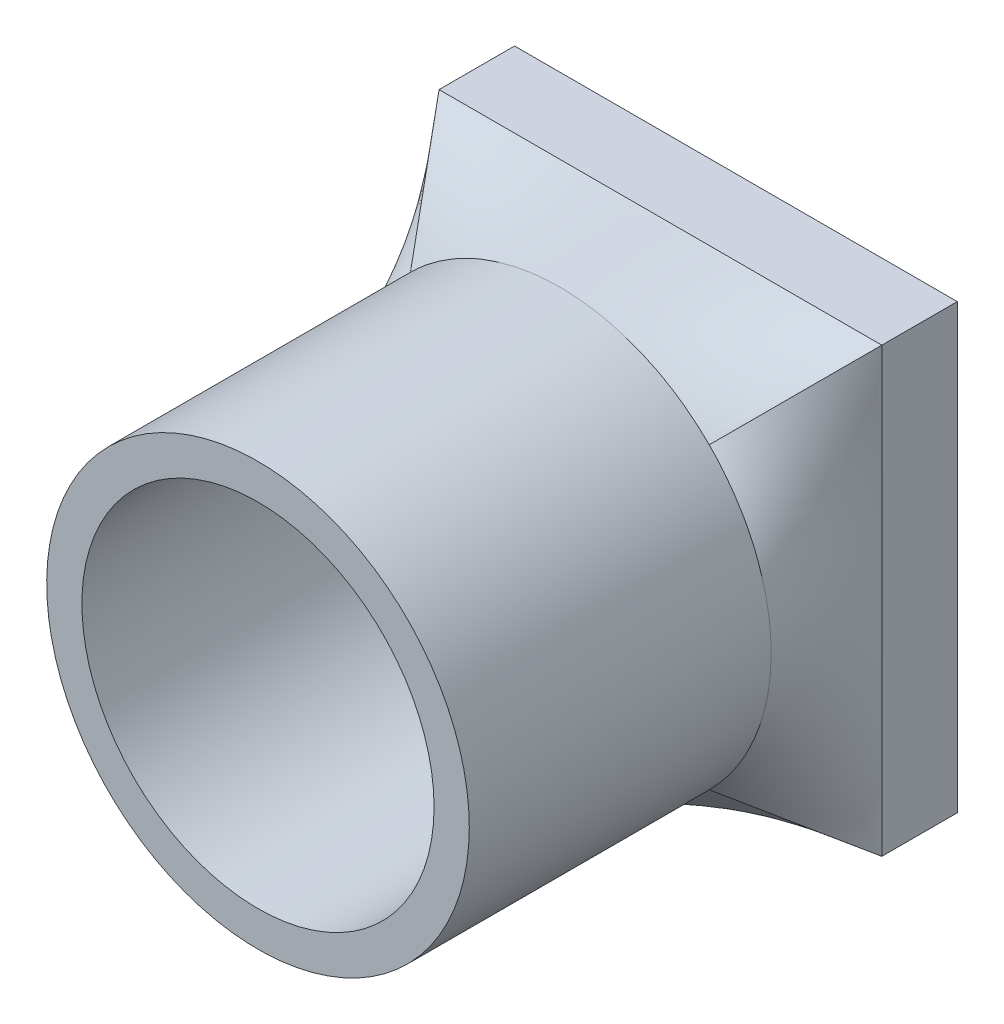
ISO-10303-21;
HEADER;
FILE_DESCRIPTION(('STEP AP214'),'2;1');
FILE_NAME('part.step','',(''),(''),'','','');
FILE_SCHEMA(('AUTOMOTIVE_DESIGN { 1 0 10303 214 1 1 1 1 }'));
ENDSEC;
DATA;
#1=APPLICATION_CONTEXT('core data for automotive mechanical design processes');
#2=APPLICATION_PROTOCOL_DEFINITION('international standard','automotive_design',2000,#1);
#3=PRODUCT_CONTEXT('',#1,'mechanical');
#4=PRODUCT('Part','Part','',(#3));
#5=PRODUCT_RELATED_PRODUCT_CATEGORY('part','',(#4));
#6=PRODUCT_DEFINITION_FORMATION('','',#4);
#7=PRODUCT_DEFINITION_CONTEXT('part definition',#1,'design');
#8=PRODUCT_DEFINITION('design','',#6,#7);
#9=PRODUCT_DEFINITION_SHAPE('','',#8);
#10=(LENGTH_UNIT() NAMED_UNIT(*) SI_UNIT(.MILLI.,.METRE.));
#11=(NAMED_UNIT(*) PLANE_ANGLE_UNIT() SI_UNIT($,.RADIAN.));
#12=(NAMED_UNIT(*) SI_UNIT($,.STERADIAN.) SOLID_ANGLE_UNIT());
#13=UNCERTAINTY_MEASURE_WITH_UNIT(LENGTH_MEASURE(1.E-05),#10,'distance_accuracy_value','');
#14=(GEOMETRIC_REPRESENTATION_CONTEXT(3) GLOBAL_UNCERTAINTY_ASSIGNED_CONTEXT((#13)) GLOBAL_UNIT_ASSIGNED_CONTEXT((#10,
#11,#12)) REPRESENTATION_CONTEXT('',''));
#15=CARTESIAN_POINT('',(0.,0.,0.));
#16=DIRECTION('',(0.,0.,1.));
#17=DIRECTION('',(1.,0.,0.));
#18=AXIS2_PLACEMENT_3D('',#15,#16,#17);
#19=CARTESIAN_POINT('',(0.,0.,475.));
#20=DIRECTION('',(0.,0.,-1.));
#21=DIRECTION('',(-1.,0.,0.));
#22=AXIS2_PLACEMENT_3D('',#19,#20,#21);
#23=CYLINDRICAL_SURFACE('',#22,210.);
#24=CARTESIAN_POINT('',(0.,0.,475.));
#25=DIRECTION('',(0.,0.,1.));
#26=DIRECTION('',(1.,0.,0.));
#27=AXIS2_PLACEMENT_3D('',#24,#25,#26);
#28=CIRCLE('',#27,210.);
#29=CARTESIAN_POINT('',(210.,0.,475.));
#30=VERTEX_POINT('',#29);
#31=EDGE_CURVE('E12',#30,#30,#28,.T.);
#32=ORIENTED_EDGE('',*,*,#31,.F.);
#33=EDGE_LOOP('',(#32));
#34=FACE_BOUND('',#33,.T.);
#35=CARTESIAN_POINT('',(148.492424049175,148.492424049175,175.));
#36=CARTESIAN_POINT('',(147.447995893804,149.536855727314,174.99999560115));
#37=CARTESIAN_POINT('',(146.392545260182,150.570264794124,174.999981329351));
#38=CARTESIAN_POINT('',(144.260076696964,152.614585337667,174.999953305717));
#39=CARTESIAN_POINT('',(143.183058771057,153.625496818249,174.999939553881));
#40=CARTESIAN_POINT('',(141.007861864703,155.624435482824,174.9999328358));
#41=CARTESIAN_POINT('',(139.90968150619,156.61246116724,174.999939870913));
#42=CARTESIAN_POINT('',(137.692717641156,158.565120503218,174.999969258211));
#43=CARTESIAN_POINT('',(136.573934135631,159.529754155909,174.999991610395));
#44=CARTESIAN_POINT('',(134.3162093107,161.435244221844,175.000001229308));
#45=CARTESIAN_POINT('',(133.177267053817,162.376099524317,174.9999884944));
#46=CARTESIAN_POINT('',(130.879782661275,164.233567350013,174.999945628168));
#47=CARTESIAN_POINT('',(129.721240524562,165.150179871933,174.999915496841));
#48=CARTESIAN_POINT('',(127.38503901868,166.958779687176,174.999885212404));
#49=CARTESIAN_POINT('',(126.207379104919,167.850766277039,174.999885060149));
#50=CARTESIAN_POINT('',(123.833498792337,169.609689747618,174.999915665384));
#51=CARTESIAN_POINT('',(122.637278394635,170.476626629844,174.999946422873));
#52=CARTESIAN_POINT('',(120.228673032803,172.183744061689,174.999991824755));
#53=CARTESIAN_POINT('',(119.016315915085,173.023963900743,175.000006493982));
#54=CARTESIAN_POINT('',(116.57416802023,174.678673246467,174.999968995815));
#55=CARTESIAN_POINT('',(115.344377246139,175.49316275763,174.999916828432));
#56=CARTESIAN_POINT('',(112.867966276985,177.096012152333,174.999840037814));
#57=CARTESIAN_POINT('',(111.621346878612,177.884373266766,174.999815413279));
#58=CARTESIAN_POINT('',(109.111774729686,179.434656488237,174.999815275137));
#59=CARTESIAN_POINT('',(107.848821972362,180.196578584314,174.999839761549));
#60=CARTESIAN_POINT('',(105.307247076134,181.693584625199,174.999923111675));
#61=CARTESIAN_POINT('',(104.028626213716,182.42867073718,174.999981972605));
#62=CARTESIAN_POINT('',(101.45618452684,183.871742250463,175.00000465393));
#63=CARTESIAN_POINT('',(100.16236372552,184.579727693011,174.999968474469));
#64=CARTESIAN_POINT('',(97.5602482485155,185.968202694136,174.999856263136));
#65=CARTESIAN_POINT('',(96.2519553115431,186.648695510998,174.999780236));
#66=CARTESIAN_POINT('',(93.6213210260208,187.981974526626,174.999692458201));
#67=CARTESIAN_POINT('',(92.2989795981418,188.634760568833,174.999680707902));
#68=CARTESIAN_POINT('',(89.4802925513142,189.989496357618,174.999745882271));
#69=CARTESIAN_POINT('',(87.9822219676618,190.687860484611,174.999833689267));
#70=CARTESIAN_POINT('',(84.9700050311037,192.049029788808,174.999969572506));
#71=CARTESIAN_POINT('',(83.4558585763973,192.711834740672,175.000017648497));
#72=CARTESIAN_POINT('',(80.4124668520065,194.00145947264,174.999912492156));
#73=CARTESIAN_POINT('',(78.8832228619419,194.628282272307,174.999759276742));
#74=CARTESIAN_POINT('',(75.8103668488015,195.845651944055,174.999543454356));
#75=CARTESIAN_POINT('',(74.266754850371,196.436198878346,174.999480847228));
#76=CARTESIAN_POINT('',(71.1660405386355,197.580681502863,174.999519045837));
#77=CARTESIAN_POINT('',(69.608938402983,198.134617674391,174.999619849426));
#78=CARTESIAN_POINT('',(66.4820912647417,199.205578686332,174.999872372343));
#79=CARTESIAN_POINT('',(64.9123462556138,199.722603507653,175.000024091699));
#80=CARTESIAN_POINT('',(61.7619750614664,200.71917293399,174.999969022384));
#81=CARTESIAN_POINT('',(60.1813555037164,201.198738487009,174.999762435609));
#82=CARTESIAN_POINT('',(57.0092475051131,202.120443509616,174.999388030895));
#83=CARTESIAN_POINT('',(55.4177590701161,202.562582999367,174.999220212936));
#84=CARTESIAN_POINT('',(52.2247612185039,203.409199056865,174.999140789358));
#85=CARTESIAN_POINT('',(50.6232517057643,203.813675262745,174.9992291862));
#86=CARTESIAN_POINT('',(48.2141978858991,204.391959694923,174.999488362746));
#87=CARTESIAN_POINT('',(47.4100407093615,204.57998450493,174.999595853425));
#88=CARTESIAN_POINT('',(45.7995602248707,204.946535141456,174.999805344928));
#89=CARTESIAN_POINT('',(44.9932369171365,205.125060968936,174.999907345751));
#90=CARTESIAN_POINT('',(43.3785688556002,205.472581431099,175.00000822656));
#91=CARTESIAN_POINT('',(42.5702241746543,205.641576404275,175.000007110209));
#92=CARTESIAN_POINT('',(40.9516015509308,205.97001797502,174.999878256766));
#93=CARTESIAN_POINT('',(40.1413236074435,206.129464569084,174.999750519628));
#94=CARTESIAN_POINT('',(37.7077640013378,206.593446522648,174.999328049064));
#95=CARTESIAN_POINT('',(36.0817193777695,206.88363205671,174.998994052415));
#96=CARTESIAN_POINT('',(32.9739595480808,207.400493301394,174.998659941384));
#97=CARTESIAN_POINT('',(31.4928056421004,207.630560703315,174.998631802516));
#98=CARTESIAN_POINT('',(28.5259121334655,208.058931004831,174.998904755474));
#99=CARTESIAN_POINT('',(27.0401725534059,208.257234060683,174.999205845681));
#100=CARTESIAN_POINT('',(24.0648758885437,208.621973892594,174.999779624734));
#101=CARTESIAN_POINT('',(22.5753190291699,208.788412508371,175.000052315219));
#102=CARTESIAN_POINT('',(19.5929812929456,209.089362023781,174.999909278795));
#103=CARTESIAN_POINT('',(18.1002004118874,209.223872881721,174.999493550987));
#104=CARTESIAN_POINT('',(15.112176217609,209.46089880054,174.998736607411));
#105=CARTESIAN_POINT('',(13.6169330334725,209.563415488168,174.998395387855));
#106=CARTESIAN_POINT('',(10.6245986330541,209.736415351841,174.998133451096));
#107=CARTESIAN_POINT('',(9.12750741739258,209.806898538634,174.998212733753));
#108=CARTESIAN_POINT('',(6.13174108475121,209.915813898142,174.998737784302));
#109=CARTESIAN_POINT('',(4.63306564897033,209.954237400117,174.999183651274));
#110=CARTESIAN_POINT('',(2.38471942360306,209.98779716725,174.999726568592));
#111=CARTESIAN_POINT('',(1.63520978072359,209.994971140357,174.999886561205));
#112=CARTESIAN_POINT('',(0.13615352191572,210.001293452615,175.000022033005));
#113=CARTESIAN_POINT('',(-0.61339309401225,210.000441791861,174.999997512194));
#114=CARTESIAN_POINT('',(-2.11247278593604,209.990712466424,174.999795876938));
#115=CARTESIAN_POINT('',(-2.86200585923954,209.981834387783,174.999618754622));
#116=CARTESIAN_POINT('',(-4.36093119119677,209.95605290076,174.999236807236));
#117=CARTESIAN_POINT('',(-5.11032344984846,209.939149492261,174.999031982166));
#118=CARTESIAN_POINT('',(-7.35815988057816,209.876403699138,174.998491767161));
#119=CARTESIAN_POINT('',(-8.85628492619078,209.818525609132,174.998230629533));
#120=CARTESIAN_POINT('',(-11.8511674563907,209.670689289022,174.998172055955));
#121=CARTESIAN_POINT('',(-13.347924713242,209.580726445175,174.998374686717));
#122=CARTESIAN_POINT('',(-15.5913345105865,209.421757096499,174.998857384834));
#123=CARTESIAN_POINT('',(-16.3388552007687,209.364762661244,174.999048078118));
#124=CARTESIAN_POINT('',(-17.8332462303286,209.242771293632,174.999422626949));
#125=CARTESIAN_POINT('',(-18.5801165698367,209.177774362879,174.999606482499));
#126=CARTESIAN_POINT('',(-20.0609608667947,209.04090920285,174.999887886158));
#127=CARTESIAN_POINT('',(-20.7949467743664,208.969170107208,174.999986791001));
#128=CARTESIAN_POINT('',(-22.2621219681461,208.817963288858,175.000010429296));
#129=CARTESIAN_POINT('',(-22.9953112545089,208.738495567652,174.999935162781));
#130=CARTESIAN_POINT('',(-24.4608121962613,208.571840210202,174.999712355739));
#131=CARTESIAN_POINT('',(-25.193123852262,208.484652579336,174.999564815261));
#132=CARTESIAN_POINT('',(-26.6567848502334,208.302567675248,174.999272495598));
#133=CARTESIAN_POINT('',(-27.3881341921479,208.207670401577,174.999127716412));
#134=CARTESIAN_POINT('',(-29.5808576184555,207.911396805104,174.998775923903));
#135=CARTESIAN_POINT('',(-31.0406885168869,207.698463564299,174.998651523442));
#136=CARTESIAN_POINT('',(-33.9555236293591,207.241884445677,174.998721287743));
#137=CARTESIAN_POINT('',(-35.4105278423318,206.998238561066,174.998915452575));
#138=CARTESIAN_POINT('',(-38.3152159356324,206.480315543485,174.999419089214));
#139=CARTESIAN_POINT('',(-39.7648993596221,206.206035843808,174.999728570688));
#140=CARTESIAN_POINT('',(-41.9348237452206,205.771753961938,174.999967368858));
#141=CARTESIAN_POINT('',(-42.6573699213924,205.62318187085,175.000009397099));
#142=CARTESIAN_POINT('',(-44.1008571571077,205.318432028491,174.999982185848));
#143=CARTESIAN_POINT('',(-44.8217982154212,205.162254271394,174.99991294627));
#144=CARTESIAN_POINT('',(-46.9820974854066,204.682336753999,174.999666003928));
#145=CARTESIAN_POINT('',(-48.4189437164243,204.347210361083,174.999449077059));
#146=CARTESIAN_POINT('',(-51.2852403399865,203.646754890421,174.999186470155));
#147=CARTESIAN_POINT('',(-52.7146907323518,203.281425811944,174.999140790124));
#148=CARTESIAN_POINT('',(-55.5670239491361,202.520336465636,174.99923989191));
#149=CARTESIAN_POINT('',(-56.9898987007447,202.124545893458,174.999384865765));
#150=CARTESIAN_POINT('',(-59.8269893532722,201.303037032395,174.99972166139));
#151=CARTESIAN_POINT('',(-61.2412050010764,200.877317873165,174.999913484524));
#152=CARTESIAN_POINT('',(-65.4697963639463,199.555573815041,175.000092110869));
#153=CARTESIAN_POINT('',(-68.2704180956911,198.61488185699,174.999682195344));
#154=CARTESIAN_POINT('',(-72.439413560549,197.11598900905,174.99947943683));
#155=CARTESIAN_POINT('',(-73.8237867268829,196.601702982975,174.999480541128));
#156=CARTESIAN_POINT('',(-76.5814127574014,195.544030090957,174.999588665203));
#157=CARTESIAN_POINT('',(-77.9546655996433,195.000643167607,174.999695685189));
#158=CARTESIAN_POINT('',(-80.6894191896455,193.885014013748,174.999898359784));
#159=CARTESIAN_POINT('',(-82.0509197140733,193.31277123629,174.999994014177));
#160=CARTESIAN_POINT('',(-84.7615408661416,192.139694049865,175.000005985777));
#161=CARTESIAN_POINT('',(-86.110661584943,191.538859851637,174.999922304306));
#162=CARTESIAN_POINT('',(-88.5852270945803,190.405377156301,174.999791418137));
#163=CARTESIAN_POINT('',(-89.7125495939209,189.876824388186,174.999740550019));
#164=CARTESIAN_POINT('',(-91.9575983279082,188.799762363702,174.999688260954));
#165=CARTESIAN_POINT('',(-93.0753246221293,188.251253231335,174.9996868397));
#166=CARTESIAN_POINT('',(-96.4136999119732,186.57598592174,174.999773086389));
#167=CARTESIAN_POINT('',(-98.6195241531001,185.419497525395,174.999951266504));
#168=CARTESIAN_POINT('',(-102.988671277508,183.028783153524,175.000020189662));
#169=CARTESIAN_POINT('',(-105.151992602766,181.794554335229,174.999910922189));
#170=CARTESIAN_POINT('',(-109.433443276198,179.249889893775,174.999810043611));
#171=CARTESIAN_POINT('',(-111.551571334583,177.939452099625,174.999818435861));
#172=CARTESIAN_POINT('',(-115.739914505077,175.244041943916,174.999911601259));
#173=CARTESIAN_POINT('',(-117.8101286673,173.859068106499,174.999996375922));
#174=CARTESIAN_POINT('',(-121.901252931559,171.015479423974,174.999993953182));
#175=CARTESIAN_POINT('',(-123.9221316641,169.55681944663,174.999906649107));
#176=CARTESIAN_POINT('',(-127.910682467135,166.568504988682,174.999877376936));
#177=CARTESIAN_POINT('',(-129.878354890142,165.038850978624,174.999935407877));
#178=CARTESIAN_POINT('',(-133.757993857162,161.910496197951,174.999989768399));
#179=CARTESIAN_POINT('',(-135.669960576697,160.311795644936,174.999986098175));
#180=CARTESIAN_POINT('',(-139.435826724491,157.047316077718,174.999956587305));
#181=CARTESIAN_POINT('',(-141.289726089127,155.381536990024,174.999930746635));
#182=CARTESIAN_POINT('',(-144.025153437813,152.834249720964,174.999946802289));
#183=CARTESIAN_POINT('',(-144.929411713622,151.977031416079,174.999961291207));
#184=CARTESIAN_POINT('',(-146.72252868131,150.246636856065,174.999987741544));
#185=CARTESIAN_POINT('',(-147.611387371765,149.373460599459,174.999999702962));
#186=CARTESIAN_POINT('',(-148.492424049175,148.492424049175,175.));
#187=B_SPLINE_CURVE_WITH_KNOTS('',3,(#35,#36,#37,#38,#39,#40,#41,#42,#43,#44,#45,#46,#47,#48,
#49,#50,#51,#52,#53,#54,#55,#56,#57,#58,#59,#60,#61,#62,#63,#64,#65,#66,#67,#68,#69,#70,#71,#72,
#73,#74,#75,#76,#77,#78,#79,#80,#81,#82,#83,#84,#85,#86,#87,#88,#89,#90,#91,#92,#93,#94,#95,#96,
#97,#98,#99,#100,#101,#102,#103,#104,#105,#106,#107,#108,#109,#110,#111,#112,#113,#114,#115,
#116,#117,#118,#119,#120,#121,#122,#123,#124,#125,#126,#127,#128,#129,#130,#131,#132,#133,#134,
#135,#136,#137,#138,#139,#140,#141,#142,#143,#144,#145,#146,#147,#148,#149,#150,#151,#152,#153,
#154,#155,#156,#157,#158,#159,#160,#161,#162,#163,#164,#165,#166,#167,#168,#169,#170,#171,#172,
#173,#174,#175,#176,#177,#178,#179,#180,#181,#182,#183,#184,#185,#186),.UNSPECIFIED.,.F.,.F.,(4,
2,2,2,2,2,2,2,2,2,2,2,2,2,2,2,2,2,2,2,2,2,2,2,2,2,2,2,2,2,2,2,2,2,2,2,2,2,2,2,2,2,2,2,2,2,2,2,2,
2,2,2,2,2,2,2,2,2,2,2,2,2,2,2,2,2,2,2,2,2,2,2,2,2,2,4),(0.,4.43105849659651,8.86211623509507,
13.2934634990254,17.7248105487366,22.1563642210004,26.5879181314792,31.019598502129,
35.4512786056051,39.8761080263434,44.3009366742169,48.7255565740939,53.1501783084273,
57.5744419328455,61.9986988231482,66.4224298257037,70.8461858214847,75.8042795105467,
80.7624046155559,85.720113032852,90.6778129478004,95.6354476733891,100.593084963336,
105.547929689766,110.502771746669,115.457661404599,117.935153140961,120.412644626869,
122.890048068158,125.36745241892,130.322147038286,134.818566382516,139.314963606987,
143.811101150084,148.307244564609,152.803159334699,157.299072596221,161.79620141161,
164.044798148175,166.293394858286,168.542107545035,170.790820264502,175.288182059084,
179.786190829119,182.035225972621,184.284260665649,186.496670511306,188.709079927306,
190.921487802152,193.133895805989,197.559371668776,201.984848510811,206.410696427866,
208.623650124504,210.836605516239,215.262479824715,219.68835424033,224.118690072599,
228.549154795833,237.409148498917,241.839345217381,246.269550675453,250.699840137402,
255.130096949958,258.86513739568,262.600154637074,270.070258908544,277.540636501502,
285.011227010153,292.481965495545,299.957336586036,307.432658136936,314.907956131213,
322.383262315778,326.121080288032,329.858898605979),.UNSPECIFIED.);
#188=CARTESIAN_POINT('',(148.492424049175,148.492424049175,175.));
#189=VERTEX_POINT('',#188);
#190=CARTESIAN_POINT('',(-148.492424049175,148.492424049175,175.));
#191=VERTEX_POINT('',#190);
#192=EDGE_CURVE('E78',#189,#191,#187,.T.);
#193=ORIENTED_EDGE('',*,*,#192,.T.);
#194=CARTESIAN_POINT('',(-148.492424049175,148.492424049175,175.));
#195=CARTESIAN_POINT('',(-149.536855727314,147.447995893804,174.99999560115));
#196=CARTESIAN_POINT('',(-150.570264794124,146.392545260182,174.999981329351));
#197=CARTESIAN_POINT('',(-152.614585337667,144.260076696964,174.999953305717));
#198=CARTESIAN_POINT('',(-153.625496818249,143.183058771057,174.999939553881));
#199=CARTESIAN_POINT('',(-155.624435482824,141.007861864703,174.9999328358));
#200=CARTESIAN_POINT('',(-156.61246116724,139.90968150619,174.999939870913));
#201=CARTESIAN_POINT('',(-158.565120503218,137.692717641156,174.999969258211));
#202=CARTESIAN_POINT('',(-159.529754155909,136.573934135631,174.999991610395));
#203=CARTESIAN_POINT('',(-161.435244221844,134.3162093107,175.000001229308));
#204=CARTESIAN_POINT('',(-162.376099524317,133.177267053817,174.9999884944));
#205=CARTESIAN_POINT('',(-164.233567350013,130.879782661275,174.999945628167));
#206=CARTESIAN_POINT('',(-165.150179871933,129.721240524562,174.999915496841));
#207=CARTESIAN_POINT('',(-166.958779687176,127.38503901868,174.999885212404));
#208=CARTESIAN_POINT('',(-167.850766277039,126.207379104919,174.999885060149));
#209=CARTESIAN_POINT('',(-169.609689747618,123.833498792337,174.999915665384));
#210=CARTESIAN_POINT('',(-170.476626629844,122.637278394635,174.999946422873));
#211=CARTESIAN_POINT('',(-172.183744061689,120.228673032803,174.999991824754));
#212=CARTESIAN_POINT('',(-173.023963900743,119.016315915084,175.000006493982));
#213=CARTESIAN_POINT('',(-174.678673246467,116.57416802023,174.999968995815));
#214=CARTESIAN_POINT('',(-175.49316275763,115.344377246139,174.999916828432));
#215=CARTESIAN_POINT('',(-177.096012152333,112.867966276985,174.999840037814));
#216=CARTESIAN_POINT('',(-177.884373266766,111.621346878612,174.999815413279));
#217=CARTESIAN_POINT('',(-179.434656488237,109.111774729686,174.999815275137));
#218=CARTESIAN_POINT('',(-180.196578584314,107.848821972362,174.999839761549));
#219=CARTESIAN_POINT('',(-181.693584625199,105.307247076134,174.999923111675));
#220=CARTESIAN_POINT('',(-182.428670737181,104.028626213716,174.999981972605));
#221=CARTESIAN_POINT('',(-183.871742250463,101.45618452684,175.00000465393));
#222=CARTESIAN_POINT('',(-184.579727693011,100.16236372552,174.999968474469));
#223=CARTESIAN_POINT('',(-185.968202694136,97.5602482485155,174.999856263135));
#224=CARTESIAN_POINT('',(-186.648695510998,96.2519553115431,174.999780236));
#225=CARTESIAN_POINT('',(-187.981974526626,93.6213210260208,174.999692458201));
#226=CARTESIAN_POINT('',(-188.634760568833,92.2989795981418,174.999680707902));
#227=CARTESIAN_POINT('',(-189.989496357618,89.4802925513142,174.999745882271));
#228=CARTESIAN_POINT('',(-190.687860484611,87.9822219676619,174.999833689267));
#229=CARTESIAN_POINT('',(-192.049029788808,84.9700050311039,174.999969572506));
#230=CARTESIAN_POINT('',(-192.711834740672,83.4558585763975,175.000017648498));
#231=CARTESIAN_POINT('',(-194.00145947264,80.4124668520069,174.999912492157));
#232=CARTESIAN_POINT('',(-194.628282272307,78.8832228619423,174.999759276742));
#233=CARTESIAN_POINT('',(-195.845651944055,75.810366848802,174.999543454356));
#234=CARTESIAN_POINT('',(-196.436198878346,74.2667548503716,174.999480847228));
#235=CARTESIAN_POINT('',(-197.580681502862,71.1660405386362,174.999519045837));
#236=CARTESIAN_POINT('',(-198.134617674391,69.6089384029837,174.999619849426));
#237=CARTESIAN_POINT('',(-199.205578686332,66.4820912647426,174.999872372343));
#238=CARTESIAN_POINT('',(-199.722603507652,64.9123462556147,175.000024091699));
#239=CARTESIAN_POINT('',(-200.719172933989,61.7619750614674,174.999969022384));
#240=CARTESIAN_POINT('',(-201.198738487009,60.1813555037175,174.999762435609));
#241=CARTESIAN_POINT('',(-202.120443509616,57.0092475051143,174.999388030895));
#242=CARTESIAN_POINT('',(-202.562582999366,55.4177590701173,174.999220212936));
#243=CARTESIAN_POINT('',(-203.409199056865,52.2247612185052,174.999140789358));
#244=CARTESIAN_POINT('',(-203.813675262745,50.6232517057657,174.9992291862));
#245=CARTESIAN_POINT('',(-204.391959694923,48.2141978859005,174.999488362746));
#246=CARTESIAN_POINT('',(-204.579984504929,47.410040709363,174.999595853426));
#247=CARTESIAN_POINT('',(-204.946535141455,45.7995602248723,174.999805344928));
#248=CARTESIAN_POINT('',(-205.125060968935,44.993236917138,174.999907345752));
#249=CARTESIAN_POINT('',(-205.472581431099,43.3785688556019,175.00000822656));
#250=CARTESIAN_POINT('',(-205.641576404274,42.570224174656,175.000007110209));
#251=CARTESIAN_POINT('',(-205.97001797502,40.9516015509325,174.999878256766));
#252=CARTESIAN_POINT('',(-206.129464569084,40.1413236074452,174.999750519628));
#253=CARTESIAN_POINT('',(-206.593446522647,37.7077640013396,174.999328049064));
#254=CARTESIAN_POINT('',(-206.88363205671,36.0817193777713,174.998994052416));
#255=CARTESIAN_POINT('',(-207.400493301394,32.9739595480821,174.998659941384));
#256=CARTESIAN_POINT('',(-207.630560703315,31.4928056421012,174.998631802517));
#257=CARTESIAN_POINT('',(-208.058931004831,28.5259121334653,174.998904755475));
#258=CARTESIAN_POINT('',(-208.257234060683,27.0401725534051,174.999205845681));
#259=CARTESIAN_POINT('',(-208.621973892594,24.0648758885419,174.999779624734));
#260=CARTESIAN_POINT('',(-208.788412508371,22.5753190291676,175.000052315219));
#261=CARTESIAN_POINT('',(-209.089362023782,19.5929812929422,174.999909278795));
#262=CARTESIAN_POINT('',(-209.223872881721,18.1002004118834,174.999493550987));
#263=CARTESIAN_POINT('',(-209.46089880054,15.112176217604,174.998736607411));
#264=CARTESIAN_POINT('',(-209.563415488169,13.6169330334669,174.998395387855));
#265=CARTESIAN_POINT('',(-209.736415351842,10.6245986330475,174.998133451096));
#266=CARTESIAN_POINT('',(-209.806898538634,9.12750741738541,174.998212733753));
#267=CARTESIAN_POINT('',(-209.915813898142,6.13174108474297,174.998737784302));
#268=CARTESIAN_POINT('',(-209.954237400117,4.63306564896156,174.999183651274));
#269=CARTESIAN_POINT('',(-209.98779716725,2.38471942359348,174.999726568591));
#270=CARTESIAN_POINT('',(-209.994971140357,1.63520978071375,174.999886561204));
#271=CARTESIAN_POINT('',(-210.001293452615,0.136153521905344,175.000022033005));
#272=CARTESIAN_POINT('',(-210.000441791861,-0.613393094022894,174.999997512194));
#273=CARTESIAN_POINT('',(-209.990712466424,-2.11247278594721,174.999795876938));
#274=CARTESIAN_POINT('',(-209.981834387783,-2.86200585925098,174.999618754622));
#275=CARTESIAN_POINT('',(-209.95605290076,-4.36093119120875,174.999236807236));
#276=CARTESIAN_POINT('',(-209.93914949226,-5.1103234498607,174.999031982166));
#277=CARTESIAN_POINT('',(-209.876403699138,-7.3581598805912,174.99849176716));
#278=CARTESIAN_POINT('',(-209.818525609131,-8.85628492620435,174.998230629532));
#279=CARTESIAN_POINT('',(-209.670689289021,-11.8511674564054,174.998172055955));
#280=CARTESIAN_POINT('',(-209.580726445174,-13.3479247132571,174.998374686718));
#281=CARTESIAN_POINT('',(-209.421757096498,-15.5913345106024,174.998857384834));
#282=CARTESIAN_POINT('',(-209.364762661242,-16.3388552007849,174.999048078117));
#283=CARTESIAN_POINT('',(-209.242771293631,-17.8332462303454,174.999422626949));
#284=CARTESIAN_POINT('',(-209.177774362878,-18.5801165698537,174.999606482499));
#285=CARTESIAN_POINT('',(-209.040909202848,-20.060960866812,174.999887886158));
#286=CARTESIAN_POINT('',(-208.969170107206,-20.7949467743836,174.999986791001));
#287=CARTESIAN_POINT('',(-208.817963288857,-22.2621219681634,175.000010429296));
#288=CARTESIAN_POINT('',(-208.73849556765,-22.9953112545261,174.999935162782));
#289=CARTESIAN_POINT('',(-208.5718402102,-24.4608121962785,174.999712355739));
#290=CARTESIAN_POINT('',(-208.484652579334,-25.1931238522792,174.999564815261));
#291=CARTESIAN_POINT('',(-208.302567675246,-26.6567848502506,174.999272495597));
#292=CARTESIAN_POINT('',(-208.207670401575,-27.3881341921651,174.999127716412));
#293=CARTESIAN_POINT('',(-207.911396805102,-29.5808576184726,174.998775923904));
#294=CARTESIAN_POINT('',(-207.698463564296,-31.0406885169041,174.998651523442));
#295=CARTESIAN_POINT('',(-207.241884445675,-33.9555236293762,174.998721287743));
#296=CARTESIAN_POINT('',(-206.998238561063,-35.4105278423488,174.998915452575));
#297=CARTESIAN_POINT('',(-206.480315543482,-38.3152159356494,174.999419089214));
#298=CARTESIAN_POINT('',(-206.206035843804,-39.7648993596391,174.999728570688));
#299=CARTESIAN_POINT('',(-205.771753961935,-41.9348237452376,174.999967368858));
#300=CARTESIAN_POINT('',(-205.623181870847,-42.6573699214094,175.000009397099));
#301=CARTESIAN_POINT('',(-205.318432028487,-44.1008571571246,174.999982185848));
#302=CARTESIAN_POINT('',(-205.16225427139,-44.8217982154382,174.99991294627));
#303=CARTESIAN_POINT('',(-204.682336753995,-46.9820974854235,174.999666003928));
#304=CARTESIAN_POINT('',(-204.347210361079,-48.4189437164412,174.999449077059));
#305=CARTESIAN_POINT('',(-203.646754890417,-51.2852403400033,174.999186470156));
#306=CARTESIAN_POINT('',(-203.281425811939,-52.7146907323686,174.999140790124));
#307=CARTESIAN_POINT('',(-202.520336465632,-55.5670239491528,174.99923989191));
#308=CARTESIAN_POINT('',(-202.124545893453,-56.9898987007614,174.999384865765));
#309=CARTESIAN_POINT('',(-201.30303703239,-59.8269893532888,174.99972166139));
#310=CARTESIAN_POINT('',(-200.87731787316,-61.241205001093,174.999913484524));
#311=CARTESIAN_POINT('',(-199.555573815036,-65.4697963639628,175.000092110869));
#312=CARTESIAN_POINT('',(-198.614881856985,-68.2704180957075,174.999682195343));
#313=CARTESIAN_POINT('',(-197.115989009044,-72.4394135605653,174.99947943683));
#314=CARTESIAN_POINT('',(-196.601702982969,-73.8237867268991,174.999480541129));
#315=CARTESIAN_POINT('',(-195.54403009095,-76.5814127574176,174.999588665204));
#316=CARTESIAN_POINT('',(-195.0006431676,-77.9546655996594,174.999695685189));
#317=CARTESIAN_POINT('',(-193.885014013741,-80.6894191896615,174.999898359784));
#318=CARTESIAN_POINT('',(-193.312771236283,-82.0509197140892,174.999994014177));
#319=CARTESIAN_POINT('',(-192.139694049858,-84.7615408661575,175.000005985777));
#320=CARTESIAN_POINT('',(-191.53885985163,-86.1106615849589,174.999922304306));
#321=CARTESIAN_POINT('',(-190.405377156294,-88.5852270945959,174.999791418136));
#322=CARTESIAN_POINT('',(-189.876824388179,-89.712549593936,174.999740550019));
#323=CARTESIAN_POINT('',(-188.799762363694,-91.9575983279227,174.999688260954));
#324=CARTESIAN_POINT('',(-188.251253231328,-93.0753246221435,174.9996868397));
#325=CARTESIAN_POINT('',(-186.575985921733,-96.4136999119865,174.999773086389));
#326=CARTESIAN_POINT('',(-185.419497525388,-98.6195241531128,174.999951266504));
#327=CARTESIAN_POINT('',(-183.028783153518,-102.988671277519,175.000020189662));
#328=CARTESIAN_POINT('',(-181.794554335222,-105.151992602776,174.999910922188));
#329=CARTESIAN_POINT('',(-179.249889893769,-109.433443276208,174.999810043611));
#330=CARTESIAN_POINT('',(-177.939452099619,-111.551571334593,174.99981843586));
#331=CARTESIAN_POINT('',(-175.244041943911,-115.739914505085,174.999911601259));
#332=CARTESIAN_POINT('',(-173.859068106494,-117.810128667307,174.999996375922));
#333=CARTESIAN_POINT('',(-171.015479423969,-121.901252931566,174.999993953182));
#334=CARTESIAN_POINT('',(-169.556819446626,-123.922131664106,174.999906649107));
#335=CARTESIAN_POINT('',(-166.568504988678,-127.91068246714,174.999877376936));
#336=CARTESIAN_POINT('',(-165.03885097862,-129.878354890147,174.999935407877));
#337=CARTESIAN_POINT('',(-161.910496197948,-133.757993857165,174.999989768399));
#338=CARTESIAN_POINT('',(-160.311795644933,-135.6699605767,174.999986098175));
#339=CARTESIAN_POINT('',(-157.047316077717,-139.435826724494,174.999956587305));
#340=CARTESIAN_POINT('',(-155.381536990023,-141.289726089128,174.999930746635));
#341=CARTESIAN_POINT('',(-152.834249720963,-144.025153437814,174.999946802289));
#342=CARTESIAN_POINT('',(-151.977031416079,-144.929411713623,174.999961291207));
#343=CARTESIAN_POINT('',(-150.246636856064,-146.72252868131,174.999987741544));
#344=CARTESIAN_POINT('',(-149.373460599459,-147.611387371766,174.999999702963));
#345=CARTESIAN_POINT('',(-148.492424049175,-148.492424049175,175.));
#346=B_SPLINE_CURVE_WITH_KNOTS('',3,(#194,#195,#196,#197,#198,#199,#200,#201,#202,#203,#204,
#205,#206,#207,#208,#209,#210,#211,#212,#213,#214,#215,#216,#217,#218,#219,#220,#221,#222,#223,
#224,#225,#226,#227,#228,#229,#230,#231,#232,#233,#234,#235,#236,#237,#238,#239,#240,#241,#242,
#243,#244,#245,#246,#247,#248,#249,#250,#251,#252,#253,#254,#255,#256,#257,#258,#259,#260,#261,
#262,#263,#264,#265,#266,#267,#268,#269,#270,#271,#272,#273,#274,#275,#276,#277,#278,#279,#280,
#281,#282,#283,#284,#285,#286,#287,#288,#289,#290,#291,#292,#293,#294,#295,#296,#297,#298,#299,
#300,#301,#302,#303,#304,#305,#306,#307,#308,#309,#310,#311,#312,#313,#314,#315,#316,#317,#318,
#319,#320,#321,#322,#323,#324,#325,#326,#327,#328,#329,#330,#331,#332,#333,#334,#335,#336,#337,
#338,#339,#340,#341,#342,#343,#344,#345),.UNSPECIFIED.,.F.,.F.,(4,2,2,2,2,2,2,2,2,2,2,2,2,2,2,2,
2,2,2,2,2,2,2,2,2,2,2,2,2,2,2,2,2,2,2,2,2,2,2,2,2,2,2,2,2,2,2,2,2,2,2,2,2,2,2,2,2,2,2,2,2,2,2,2,
2,2,2,2,2,2,2,2,2,2,2,4),(0.,4.43105849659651,8.86211623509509,13.2934634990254,
17.7248105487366,22.1563642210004,26.5879181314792,31.0195985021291,35.4512786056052,
39.8761080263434,44.3009366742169,48.7255565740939,53.1501783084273,57.5744419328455,
61.9986988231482,66.4224298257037,70.8461858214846,75.8042795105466,80.7624046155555,
85.7201130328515,90.6778129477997,95.6354476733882,100.593084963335,105.547929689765,
110.502771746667,115.457661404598,117.93515314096,120.412644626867,122.890048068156,
125.367452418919,130.322147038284,134.818566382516,139.314963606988,143.811101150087,
148.307244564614,152.803159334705,157.299072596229,161.79620141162,164.044798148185,
166.293394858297,168.542107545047,170.790820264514,175.288182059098,179.786190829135,
182.035225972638,184.284260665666,186.496670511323,188.709079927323,190.921487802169,
193.133895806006,197.559371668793,201.984848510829,206.410696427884,208.623650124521,
210.836605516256,215.262479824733,219.688354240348,224.118690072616,228.54915479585,
237.409148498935,241.839345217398,246.26955067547,250.699840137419,255.130096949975,
258.865137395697,262.600154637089,270.070258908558,277.540636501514,285.011227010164,
292.481965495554,299.957336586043,307.432658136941,314.907956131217,322.38326231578,
326.121080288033,329.858898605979),.UNSPECIFIED.);
#347=CARTESIAN_POINT('',(-148.492424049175,-148.492424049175,175.));
#348=VERTEX_POINT('',#347);
#349=EDGE_CURVE('E224',#191,#348,#346,.T.);
#350=ORIENTED_EDGE('',*,*,#349,.T.);
#351=CARTESIAN_POINT('',(-148.492424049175,-148.492424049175,175.));
#352=CARTESIAN_POINT('',(-147.447995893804,-149.536855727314,174.99999560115));
#353=CARTESIAN_POINT('',(-146.392545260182,-150.570264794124,174.999981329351));
#354=CARTESIAN_POINT('',(-144.260076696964,-152.614585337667,174.999953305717));
#355=CARTESIAN_POINT('',(-143.183058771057,-153.625496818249,174.999939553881));
#356=CARTESIAN_POINT('',(-141.007861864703,-155.624435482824,174.9999328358));
#357=CARTESIAN_POINT('',(-139.90968150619,-156.61246116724,174.999939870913));
#358=CARTESIAN_POINT('',(-137.692717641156,-158.565120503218,174.999969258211));
#359=CARTESIAN_POINT('',(-136.573934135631,-159.529754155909,174.999991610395));
#360=CARTESIAN_POINT('',(-134.3162093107,-161.435244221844,175.000001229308));
#361=CARTESIAN_POINT('',(-133.177267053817,-162.376099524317,174.9999884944));
#362=CARTESIAN_POINT('',(-130.879782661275,-164.233567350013,174.999945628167));
#363=CARTESIAN_POINT('',(-129.721240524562,-165.150179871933,174.999915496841));
#364=CARTESIAN_POINT('',(-127.38503901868,-166.958779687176,174.999885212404));
#365=CARTESIAN_POINT('',(-126.207379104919,-167.850766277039,174.999885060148));
#366=CARTESIAN_POINT('',(-123.833498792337,-169.609689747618,174.999915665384));
#367=CARTESIAN_POINT('',(-122.637278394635,-170.476626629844,174.999946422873));
#368=CARTESIAN_POINT('',(-120.228673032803,-172.183744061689,174.999991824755));
#369=CARTESIAN_POINT('',(-119.016315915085,-173.023963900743,175.000006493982));
#370=CARTESIAN_POINT('',(-116.57416802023,-174.678673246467,174.999968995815));
#371=CARTESIAN_POINT('',(-115.344377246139,-175.49316275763,174.999916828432));
#372=CARTESIAN_POINT('',(-112.867966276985,-177.096012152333,174.999840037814));
#373=CARTESIAN_POINT('',(-111.621346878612,-177.884373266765,174.999815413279));
#374=CARTESIAN_POINT('',(-109.111774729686,-179.434656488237,174.999815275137));
#375=CARTESIAN_POINT('',(-107.848821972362,-180.196578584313,174.999839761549));
#376=CARTESIAN_POINT('',(-105.307247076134,-181.693584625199,174.999923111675));
#377=CARTESIAN_POINT('',(-104.028626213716,-182.42867073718,174.999981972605));
#378=CARTESIAN_POINT('',(-101.45618452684,-183.871742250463,175.00000465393));
#379=CARTESIAN_POINT('',(-100.16236372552,-184.579727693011,174.99996847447));
#380=CARTESIAN_POINT('',(-97.5602482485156,-185.968202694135,174.999856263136));
#381=CARTESIAN_POINT('',(-96.2519553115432,-186.648695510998,174.999780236));
#382=CARTESIAN_POINT('',(-93.6213210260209,-187.981974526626,174.999692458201));
#383=CARTESIAN_POINT('',(-92.2989795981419,-188.634760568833,174.999680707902));
#384=CARTESIAN_POINT('',(-89.4802925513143,-189.989496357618,174.999745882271));
#385=CARTESIAN_POINT('',(-87.982221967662,-190.687860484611,174.999833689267));
#386=CARTESIAN_POINT('',(-84.970005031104,-192.049029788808,174.999969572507));
#387=CARTESIAN_POINT('',(-83.4558585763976,-192.711834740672,175.000017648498));
#388=CARTESIAN_POINT('',(-80.412466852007,-194.00145947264,174.999912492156));
#389=CARTESIAN_POINT('',(-78.8832228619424,-194.628282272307,174.999759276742));
#390=CARTESIAN_POINT('',(-75.8103668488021,-195.845651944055,174.999543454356));
#391=CARTESIAN_POINT('',(-74.2667548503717,-196.436198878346,174.999480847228));
#392=CARTESIAN_POINT('',(-71.1660405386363,-197.580681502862,174.999519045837));
#393=CARTESIAN_POINT('',(-69.6089384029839,-198.134617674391,174.999619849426));
#394=CARTESIAN_POINT('',(-66.4820912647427,-199.205578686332,174.999872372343));
#395=CARTESIAN_POINT('',(-64.9123462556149,-199.722603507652,175.000024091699));
#396=CARTESIAN_POINT('',(-61.7619750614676,-200.719172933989,174.999969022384));
#397=CARTESIAN_POINT('',(-60.1813555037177,-201.198738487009,174.999762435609));
#398=CARTESIAN_POINT('',(-57.0092475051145,-202.120443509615,174.999388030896));
#399=CARTESIAN_POINT('',(-55.4177590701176,-202.562582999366,174.999220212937));
#400=CARTESIAN_POINT('',(-52.2247612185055,-203.409199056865,174.999140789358));
#401=CARTESIAN_POINT('',(-50.6232517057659,-203.813675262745,174.9992291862));
#402=CARTESIAN_POINT('',(-48.2141978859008,-204.391959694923,174.999488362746));
#403=CARTESIAN_POINT('',(-47.4100407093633,-204.579984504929,174.999595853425));
#404=CARTESIAN_POINT('',(-45.7995602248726,-204.946535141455,174.999805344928));
#405=CARTESIAN_POINT('',(-44.9932369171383,-205.125060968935,174.999907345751));
#406=CARTESIAN_POINT('',(-43.3785688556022,-205.472581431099,175.000008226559));
#407=CARTESIAN_POINT('',(-42.5702241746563,-205.641576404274,175.000007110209));
#408=CARTESIAN_POINT('',(-40.9516015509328,-205.97001797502,174.999878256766));
#409=CARTESIAN_POINT('',(-40.1413236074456,-206.129464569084,174.999750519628));
#410=CARTESIAN_POINT('',(-37.7077640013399,-206.593446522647,174.999328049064));
#411=CARTESIAN_POINT('',(-36.0817193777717,-206.88363205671,174.998994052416));
#412=CARTESIAN_POINT('',(-32.9739595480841,-207.400493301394,174.998659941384));
#413=CARTESIAN_POINT('',(-31.4928056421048,-207.630560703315,174.998631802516));
#414=CARTESIAN_POINT('',(-28.5259121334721,-208.05893100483,174.998904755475));
#415=CARTESIAN_POINT('',(-27.0401725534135,-208.257234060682,174.999205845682));
#416=CARTESIAN_POINT('',(-24.0648758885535,-208.621973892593,174.999779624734));
#417=CARTESIAN_POINT('',(-22.5753190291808,-208.788412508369,175.000052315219));
#418=CARTESIAN_POINT('',(-19.5929812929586,-209.08936202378,174.999909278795));
#419=CARTESIAN_POINT('',(-18.1002004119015,-209.22387288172,174.999493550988));
#420=CARTESIAN_POINT('',(-15.1121762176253,-209.460898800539,174.998736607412));
#421=CARTESIAN_POINT('',(-13.6169330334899,-209.563415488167,174.998395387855));
#422=CARTESIAN_POINT('',(-10.6245986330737,-209.73641535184,174.998133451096));
#423=CARTESIAN_POINT('',(-9.12750741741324,-209.806898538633,174.998212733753));
#424=CARTESIAN_POINT('',(-6.13174108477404,-209.915813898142,174.998737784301));
#425=CARTESIAN_POINT('',(-4.63306564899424,-209.954237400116,174.999183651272));
#426=CARTESIAN_POINT('',(-2.3847194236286,-209.98779716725,174.999726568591));
#427=CARTESIAN_POINT('',(-1.63520978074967,-209.994971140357,174.999886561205));
#428=CARTESIAN_POINT('',(-0.136153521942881,-210.001293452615,175.000022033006));
#429=CARTESIAN_POINT('',(0.613393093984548,-210.000441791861,174.999997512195));
#430=CARTESIAN_POINT('',(2.11247278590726,-209.990712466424,174.999795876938));
#431=CARTESIAN_POINT('',(2.86200585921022,-209.981834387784,174.999618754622));
#432=CARTESIAN_POINT('',(4.36093119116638,-209.956052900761,174.999236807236));
#433=CARTESIAN_POINT('',(5.11032344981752,-209.939149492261,174.999031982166));
#434=CARTESIAN_POINT('',(7.35815988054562,-209.876403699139,174.99849176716));
#435=CARTESIAN_POINT('',(8.85628492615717,-209.818525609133,174.998230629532));
#436=CARTESIAN_POINT('',(11.851167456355,-209.670689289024,174.998172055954));
#437=CARTESIAN_POINT('',(13.3479247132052,-209.580726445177,174.998374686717));
#438=CARTESIAN_POINT('',(15.5913345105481,-209.421757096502,174.998857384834));
#439=CARTESIAN_POINT('',(16.3388552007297,-209.364762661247,174.999048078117));
#440=CARTESIAN_POINT('',(17.8332462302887,-209.242771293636,174.999422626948));
#441=CARTESIAN_POINT('',(18.5801165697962,-209.177774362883,174.999606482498));
#442=CARTESIAN_POINT('',(20.0609608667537,-209.040909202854,174.999887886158));
#443=CARTESIAN_POINT('',(20.7949467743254,-208.969170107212,174.999986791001));
#444=CARTESIAN_POINT('',(22.2621219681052,-208.817963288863,175.000010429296));
#445=CARTESIAN_POINT('',(22.9953112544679,-208.738495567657,174.999935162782));
#446=CARTESIAN_POINT('',(24.4608121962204,-208.571840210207,174.999712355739));
#447=CARTESIAN_POINT('',(25.1931238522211,-208.484652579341,174.999564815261));
#448=CARTESIAN_POINT('',(26.6567848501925,-208.302567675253,174.999272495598));
#449=CARTESIAN_POINT('',(27.3881341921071,-208.207670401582,174.999127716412));
#450=CARTESIAN_POINT('',(29.5808576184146,-207.91139680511,174.998775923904));
#451=CARTESIAN_POINT('',(31.0406885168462,-207.698463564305,174.998651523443));
#452=CARTESIAN_POINT('',(33.9555236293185,-207.241884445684,174.998721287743));
#453=CARTESIAN_POINT('',(35.4105278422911,-206.998238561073,174.998915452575));
#454=CARTESIAN_POINT('',(38.3152159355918,-206.480315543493,174.999419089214));
#455=CARTESIAN_POINT('',(39.7648993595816,-206.206035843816,174.999728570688));
#456=CARTESIAN_POINT('',(41.9348237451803,-205.771753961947,174.999967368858));
#457=CARTESIAN_POINT('',(42.657369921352,-205.623181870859,175.000009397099));
#458=CARTESIAN_POINT('',(44.1008571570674,-205.3184320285,174.999982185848));
#459=CARTESIAN_POINT('',(44.821798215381,-205.162254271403,174.99991294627));
#460=CARTESIAN_POINT('',(46.9820974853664,-204.682336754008,174.999666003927));
#461=CARTESIAN_POINT('',(48.4189437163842,-204.347210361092,174.999449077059));
#462=CARTESIAN_POINT('',(51.2852403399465,-203.646754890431,174.999186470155));
#463=CARTESIAN_POINT('',(52.7146907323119,-203.281425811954,174.999140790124));
#464=CARTESIAN_POINT('',(55.5670239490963,-202.520336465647,174.99923989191));
#465=CARTESIAN_POINT('',(56.989898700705,-202.124545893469,174.999384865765));
#466=CARTESIAN_POINT('',(59.8269893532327,-201.303037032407,174.999721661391));
#467=CARTESIAN_POINT('',(61.241205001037,-200.877317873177,174.999913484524));
#468=CARTESIAN_POINT('',(65.4697963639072,-199.555573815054,175.000092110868));
#469=CARTESIAN_POINT('',(68.2704180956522,-198.614881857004,174.999682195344));
#470=CARTESIAN_POINT('',(72.4394135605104,-197.115989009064,174.999479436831));
#471=CARTESIAN_POINT('',(73.8237867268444,-196.60170298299,174.999480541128));
#472=CARTESIAN_POINT('',(76.5814127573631,-195.544030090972,174.999588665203));
#473=CARTESIAN_POINT('',(77.9546655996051,-195.000643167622,174.999695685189));
#474=CARTESIAN_POINT('',(80.6894191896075,-193.885014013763,174.999898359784));
#475=CARTESIAN_POINT('',(82.0509197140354,-193.312771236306,174.999994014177));
#476=CARTESIAN_POINT('',(84.761540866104,-192.139694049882,175.000005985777));
#477=CARTESIAN_POINT('',(86.1106615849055,-191.538859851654,174.999922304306));
#478=CARTESIAN_POINT('',(88.5852270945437,-190.405377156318,174.999791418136));
#479=CARTESIAN_POINT('',(89.7125495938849,-189.876824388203,174.999740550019));
#480=CARTESIAN_POINT('',(91.9575983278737,-188.799762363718,174.999688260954));
#481=CARTESIAN_POINT('',(93.0753246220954,-188.251253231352,174.9996868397));
#482=CARTESIAN_POINT('',(96.4136999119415,-186.575985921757,174.999773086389));
#483=CARTESIAN_POINT('',(98.6195241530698,-185.419497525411,174.999951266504));
#484=CARTESIAN_POINT('',(102.98867127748,-183.02878315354,175.000020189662));
#485=CARTESIAN_POINT('',(105.151992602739,-181.794554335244,174.999910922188));
#486=CARTESIAN_POINT('',(109.433443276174,-179.24988989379,174.999810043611));
#487=CARTESIAN_POINT('',(111.551571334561,-177.939452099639,174.99981843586));
#488=CARTESIAN_POINT('',(115.739914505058,-175.244041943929,174.999911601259));
#489=CARTESIAN_POINT('',(117.810128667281,-173.859068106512,174.999996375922));
#490=CARTESIAN_POINT('',(121.901252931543,-171.015479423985,174.999993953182));
#491=CARTESIAN_POINT('',(123.922131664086,-169.556819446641,174.999906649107));
#492=CARTESIAN_POINT('',(127.910682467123,-166.568504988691,174.999877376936));
#493=CARTESIAN_POINT('',(129.878354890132,-165.038850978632,174.999935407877));
#494=CARTESIAN_POINT('',(133.757993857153,-161.910496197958,174.999989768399));
#495=CARTESIAN_POINT('',(135.66996057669,-160.311795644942,174.999986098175));
#496=CARTESIAN_POINT('',(139.435826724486,-157.047316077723,174.999956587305));
#497=CARTESIAN_POINT('',(141.289726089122,-155.381536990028,174.999930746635));
#498=CARTESIAN_POINT('',(144.025153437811,-152.834249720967,174.999946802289));
#499=CARTESIAN_POINT('',(144.92941171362,-151.977031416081,174.999961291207));
#500=CARTESIAN_POINT('',(146.722528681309,-150.246636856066,174.999987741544));
#501=CARTESIAN_POINT('',(147.611387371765,-149.373460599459,174.999999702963));
#502=CARTESIAN_POINT('',(148.492424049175,-148.492424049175,175.));
#503=B_SPLINE_CURVE_WITH_KNOTS('',3,(#351,#352,#353,#354,#355,#356,#357,#358,#359,#360,#361,
#362,#363,#364,#365,#366,#367,#368,#369,#370,#371,#372,#373,#374,#375,#376,#377,#378,#379,#380,
#381,#382,#383,#384,#385,#386,#387,#388,#389,#390,#391,#392,#393,#394,#395,#396,#397,#398,#399,
#400,#401,#402,#403,#404,#405,#406,#407,#408,#409,#410,#411,#412,#413,#414,#415,#416,#417,#418,
#419,#420,#421,#422,#423,#424,#425,#426,#427,#428,#429,#430,#431,#432,#433,#434,#435,#436,#437,
#438,#439,#440,#441,#442,#443,#444,#445,#446,#447,#448,#449,#450,#451,#452,#453,#454,#455,#456,
#457,#458,#459,#460,#461,#462,#463,#464,#465,#466,#467,#468,#469,#470,#471,#472,#473,#474,#475,
#476,#477,#478,#479,#480,#481,#482,#483,#484,#485,#486,#487,#488,#489,#490,#491,#492,#493,#494,
#495,#496,#497,#498,#499,#500,#501,#502),.UNSPECIFIED.,.F.,.F.,(4,2,2,2,2,2,2,2,2,2,2,2,2,2,2,2,
2,2,2,2,2,2,2,2,2,2,2,2,2,2,2,2,2,2,2,2,2,2,2,2,2,2,2,2,2,2,2,2,2,2,2,2,2,2,2,2,2,2,2,2,2,2,2,2,
2,2,2,2,2,2,2,2,2,2,2,4),(0.,4.43105849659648,8.86211623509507,13.2934634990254,
17.7248105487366,22.1563642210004,26.5879181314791,31.019598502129,35.4512786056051,
39.8761080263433,44.3009366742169,48.7255565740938,53.1501783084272,57.5744419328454,
61.9986988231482,66.4224298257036,70.8461858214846,75.8042795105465,80.7624046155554,
85.7201130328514,90.6778129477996,95.6354476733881,100.593084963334,105.547929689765,
110.502771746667,115.457661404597,117.935153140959,120.412644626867,122.890048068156,
125.367452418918,130.322147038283,134.818566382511,139.314963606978,143.811101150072,
148.307244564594,152.80315933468,157.299072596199,161.796201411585,164.044798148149,
166.293394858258,168.542107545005,170.79082026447,175.288182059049,179.786190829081,
182.035225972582,184.284260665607,186.496670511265,188.709079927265,190.921487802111,
193.133895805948,197.559371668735,201.98484851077,206.410696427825,208.623650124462,
210.836605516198,215.262479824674,219.688354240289,224.118690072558,228.549154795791,
237.409148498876,241.839345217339,246.269550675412,250.699840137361,255.130096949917,
258.865137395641,262.600154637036,270.070258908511,277.540636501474,285.011227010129,
292.481965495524,299.95733658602,307.432658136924,314.907956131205,322.383262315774,
326.12108028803,329.858898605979),.UNSPECIFIED.);
#504=CARTESIAN_POINT('',(148.492424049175,-148.492424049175,175.));
#505=VERTEX_POINT('',#504);
#506=EDGE_CURVE('E111',#348,#505,#503,.T.);
#507=ORIENTED_EDGE('',*,*,#506,.T.);
#508=CARTESIAN_POINT('',(148.492424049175,-148.492424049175,175.));
#509=CARTESIAN_POINT('',(149.536855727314,-147.447995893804,174.99999560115));
#510=CARTESIAN_POINT('',(150.570264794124,-146.392545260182,174.999981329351));
#511=CARTESIAN_POINT('',(152.614585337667,-144.260076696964,174.999953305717));
#512=CARTESIAN_POINT('',(153.625496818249,-143.183058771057,174.999939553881));
#513=CARTESIAN_POINT('',(155.624435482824,-141.007861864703,174.9999328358));
#514=CARTESIAN_POINT('',(156.61246116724,-139.90968150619,174.999939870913));
#515=CARTESIAN_POINT('',(158.565120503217,-137.692717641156,174.999969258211));
#516=CARTESIAN_POINT('',(159.529754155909,-136.573934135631,174.999991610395));
#517=CARTESIAN_POINT('',(161.435244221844,-134.3162093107,175.000001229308));
#518=CARTESIAN_POINT('',(162.376099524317,-133.177267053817,174.9999884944));
#519=CARTESIAN_POINT('',(164.233567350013,-130.879782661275,174.999945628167));
#520=CARTESIAN_POINT('',(165.150179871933,-129.721240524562,174.999915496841));
#521=CARTESIAN_POINT('',(166.958779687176,-127.38503901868,174.999885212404));
#522=CARTESIAN_POINT('',(167.850766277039,-126.207379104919,174.999885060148));
#523=CARTESIAN_POINT('',(169.609689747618,-123.833498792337,174.999915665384));
#524=CARTESIAN_POINT('',(170.476626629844,-122.637278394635,174.999946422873));
#525=CARTESIAN_POINT('',(172.183744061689,-120.228673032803,174.999991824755));
#526=CARTESIAN_POINT('',(173.023963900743,-119.016315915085,175.000006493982));
#527=CARTESIAN_POINT('',(174.678673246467,-116.57416802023,174.999968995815));
#528=CARTESIAN_POINT('',(175.49316275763,-115.344377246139,174.999916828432));
#529=CARTESIAN_POINT('',(177.096012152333,-112.867966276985,174.999840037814));
#530=CARTESIAN_POINT('',(177.884373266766,-111.621346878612,174.999815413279));
#531=CARTESIAN_POINT('',(179.434656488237,-109.111774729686,174.999815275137));
#532=CARTESIAN_POINT('',(180.196578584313,-107.848821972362,174.999839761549));
#533=CARTESIAN_POINT('',(181.693584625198,-105.307247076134,174.999923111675));
#534=CARTESIAN_POINT('',(182.42867073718,-104.028626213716,174.999981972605));
#535=CARTESIAN_POINT('',(183.871742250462,-101.45618452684,175.00000465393));
#536=CARTESIAN_POINT('',(184.579727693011,-100.16236372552,174.999968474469));
#537=CARTESIAN_POINT('',(185.968202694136,-97.5602482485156,174.999856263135));
#538=CARTESIAN_POINT('',(186.648695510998,-96.2519553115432,174.999780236));
#539=CARTESIAN_POINT('',(187.981974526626,-93.6213210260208,174.999692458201));
#540=CARTESIAN_POINT('',(188.634760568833,-92.2989795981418,174.999680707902));
#541=CARTESIAN_POINT('',(189.989496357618,-89.4802925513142,174.999745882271));
#542=CARTESIAN_POINT('',(190.687860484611,-87.982221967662,174.999833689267));
#543=CARTESIAN_POINT('',(192.049029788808,-84.9700050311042,174.999969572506));
#544=CARTESIAN_POINT('',(192.711834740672,-83.4558585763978,175.000017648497));
#545=CARTESIAN_POINT('',(194.00145947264,-80.4124668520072,174.999912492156));
#546=CARTESIAN_POINT('',(194.628282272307,-78.8832228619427,174.999759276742));
#547=CARTESIAN_POINT('',(195.845651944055,-75.8103668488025,174.999543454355));
#548=CARTESIAN_POINT('',(196.436198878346,-74.2667548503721,174.999480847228));
#549=CARTESIAN_POINT('',(197.580681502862,-71.1660405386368,174.999519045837));
#550=CARTESIAN_POINT('',(198.134617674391,-69.6089384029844,174.999619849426));
#551=CARTESIAN_POINT('',(199.205578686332,-66.4820912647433,174.999872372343));
#552=CARTESIAN_POINT('',(199.722603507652,-64.9123462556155,175.000024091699));
#553=CARTESIAN_POINT('',(200.719172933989,-61.7619750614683,174.999969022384));
#554=CARTESIAN_POINT('',(201.198738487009,-60.1813555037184,174.999762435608));
#555=CARTESIAN_POINT('',(202.120443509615,-57.0092475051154,174.999388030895));
#556=CARTESIAN_POINT('',(202.562582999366,-55.4177590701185,174.999220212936));
#557=CARTESIAN_POINT('',(203.409199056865,-52.2247612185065,174.999140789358));
#558=CARTESIAN_POINT('',(203.813675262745,-50.623251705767,174.999229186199));
#559=CARTESIAN_POINT('',(204.391959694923,-48.2141978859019,174.999488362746));
#560=CARTESIAN_POINT('',(204.579984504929,-47.4100407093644,174.999595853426));
#561=CARTESIAN_POINT('',(204.946535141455,-45.7995602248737,174.999805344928));
#562=CARTESIAN_POINT('',(205.125060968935,-44.9932369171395,174.999907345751));
#563=CARTESIAN_POINT('',(205.472581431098,-43.3785688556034,175.000008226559));
#564=CARTESIAN_POINT('',(205.641576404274,-42.5702241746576,175.000007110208));
#565=CARTESIAN_POINT('',(205.970017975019,-40.9516015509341,174.999878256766));
#566=CARTESIAN_POINT('',(206.129464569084,-40.1413236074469,174.999750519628));
#567=CARTESIAN_POINT('',(206.593446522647,-37.7077640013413,174.999328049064));
#568=CARTESIAN_POINT('',(206.88363205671,-36.0817193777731,174.998994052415));
#569=CARTESIAN_POINT('',(207.400493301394,-32.9739595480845,174.998659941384));
#570=CARTESIAN_POINT('',(207.630560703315,-31.4928056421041,174.998631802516));
#571=CARTESIAN_POINT('',(208.058931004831,-28.5259121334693,174.998904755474));
#572=CARTESIAN_POINT('',(208.257234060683,-27.0401725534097,174.999205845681));
#573=CARTESIAN_POINT('',(208.621973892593,-24.0648758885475,174.999779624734));
#574=CARTESIAN_POINT('',(208.78841250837,-22.5753190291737,175.000052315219));
#575=CARTESIAN_POINT('',(209.089362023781,-19.5929812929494,174.999909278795));
#576=CARTESIAN_POINT('',(209.223872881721,-18.1002004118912,174.999493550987));
#577=CARTESIAN_POINT('',(209.46089880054,-15.1121762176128,174.998736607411));
#578=CARTESIAN_POINT('',(209.563415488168,-13.6169330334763,174.998395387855));
#579=CARTESIAN_POINT('',(209.736415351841,-10.624598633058,174.998133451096));
#580=CARTESIAN_POINT('',(209.806898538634,-9.12750741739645,174.998212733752));
#581=CARTESIAN_POINT('',(209.915813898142,-6.1317410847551,174.998737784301));
#582=CARTESIAN_POINT('',(209.954237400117,-4.63306564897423,174.999183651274));
#583=CARTESIAN_POINT('',(209.98779716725,-2.38471942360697,174.999726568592));
#584=CARTESIAN_POINT('',(209.994971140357,-1.63520978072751,174.999886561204));
#585=CARTESIAN_POINT('',(210.001293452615,-0.13615352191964,175.000022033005));
#586=CARTESIAN_POINT('',(210.000441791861,0.613393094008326,174.999997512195));
#587=CARTESIAN_POINT('',(209.990712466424,2.11247278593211,174.999795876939));
#588=CARTESIAN_POINT('',(209.981834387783,2.86200585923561,174.999618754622));
#589=CARTESIAN_POINT('',(209.95605290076,4.36093119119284,174.999236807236));
#590=CARTESIAN_POINT('',(209.939149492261,5.11032344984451,174.999031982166));
#591=CARTESIAN_POINT('',(209.876403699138,7.35815988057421,174.998491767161));
#592=CARTESIAN_POINT('',(209.818525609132,8.85628492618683,174.998230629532));
#593=CARTESIAN_POINT('',(209.670689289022,11.8511674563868,174.998172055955));
#594=CARTESIAN_POINT('',(209.580726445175,13.347924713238,174.998374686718));
#595=CARTESIAN_POINT('',(209.421757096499,15.5913345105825,174.998857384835));
#596=CARTESIAN_POINT('',(209.364762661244,16.3388552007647,174.999048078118));
#597=CARTESIAN_POINT('',(209.242771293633,17.8332462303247,174.999422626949));
#598=CARTESIAN_POINT('',(209.17777436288,18.5801165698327,174.999606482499));
#599=CARTESIAN_POINT('',(209.04090920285,20.0609608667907,174.999887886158));
#600=CARTESIAN_POINT('',(208.969170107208,20.7949467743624,174.999986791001));
#601=CARTESIAN_POINT('',(208.817963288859,22.2621219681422,175.000010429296));
#602=CARTESIAN_POINT('',(208.738495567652,22.9953112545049,174.999935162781));
#603=CARTESIAN_POINT('',(208.571840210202,24.4608121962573,174.999712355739));
#604=CARTESIAN_POINT('',(208.484652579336,25.1931238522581,174.999564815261));
#605=CARTESIAN_POINT('',(208.302567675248,26.6567848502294,174.999272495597));
#606=CARTESIAN_POINT('',(208.207670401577,27.388134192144,174.999127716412));
#607=CARTESIAN_POINT('',(207.911396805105,29.5808576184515,174.998775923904));
#608=CARTESIAN_POINT('',(207.698463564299,31.040688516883,174.998651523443));
#609=CARTESIAN_POINT('',(207.241884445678,33.9555236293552,174.998721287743));
#610=CARTESIAN_POINT('',(206.998238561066,35.4105278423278,174.998915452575));
#611=CARTESIAN_POINT('',(206.480315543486,38.3152159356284,174.999419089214));
#612=CARTESIAN_POINT('',(206.206035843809,39.7648993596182,174.999728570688));
#613=CARTESIAN_POINT('',(205.771753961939,41.9348237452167,174.999967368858));
#614=CARTESIAN_POINT('',(205.623181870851,42.6573699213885,175.000009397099));
#615=CARTESIAN_POINT('',(205.318432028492,44.1008571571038,174.999982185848));
#616=CARTESIAN_POINT('',(205.162254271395,44.8217982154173,174.99991294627));
#617=CARTESIAN_POINT('',(204.682336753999,46.9820974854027,174.999666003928));
#618=CARTESIAN_POINT('',(204.347210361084,48.4189437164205,174.999449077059));
#619=CARTESIAN_POINT('',(203.646754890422,51.2852403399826,174.999186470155));
#620=CARTESIAN_POINT('',(203.281425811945,52.7146907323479,174.999140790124));
#621=CARTESIAN_POINT('',(202.520336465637,55.5670239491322,174.99923989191));
#622=CARTESIAN_POINT('',(202.124545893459,56.9898987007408,174.999384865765));
#623=CARTESIAN_POINT('',(201.303037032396,59.8269893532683,174.99972166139));
#624=CARTESIAN_POINT('',(200.877317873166,61.2412050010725,174.999913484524));
#625=CARTESIAN_POINT('',(199.555573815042,65.4697963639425,175.000092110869));
#626=CARTESIAN_POINT('',(198.614881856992,68.2704180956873,174.999682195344));
#627=CARTESIAN_POINT('',(197.115989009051,72.4394135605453,174.999479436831));
#628=CARTESIAN_POINT('',(196.601702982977,73.8237867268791,174.999480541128));
#629=CARTESIAN_POINT('',(195.544030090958,76.5814127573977,174.999588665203));
#630=CARTESIAN_POINT('',(195.000643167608,77.9546655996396,174.999695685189));
#631=CARTESIAN_POINT('',(193.885014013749,80.6894191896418,174.999898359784));
#632=CARTESIAN_POINT('',(193.312771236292,82.0509197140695,174.999994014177));
#633=CARTESIAN_POINT('',(192.139694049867,84.7615408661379,175.000005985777));
#634=CARTESIAN_POINT('',(191.538859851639,86.1106615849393,174.999922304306));
#635=CARTESIAN_POINT('',(190.405377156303,88.5852270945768,174.999791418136));
#636=CARTESIAN_POINT('',(189.876824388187,89.7125495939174,174.999740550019));
#637=CARTESIAN_POINT('',(188.799762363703,91.9575983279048,174.999688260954));
#638=CARTESIAN_POINT('',(188.251253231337,93.075324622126,174.9996868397));
#639=CARTESIAN_POINT('',(186.575985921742,96.4136999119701,174.999773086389));
#640=CARTESIAN_POINT('',(185.419497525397,98.6195241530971,174.999951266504));
#641=CARTESIAN_POINT('',(183.028783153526,102.988671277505,175.000020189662));
#642=CARTESIAN_POINT('',(181.79455433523,105.151992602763,174.999910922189));
#643=CARTESIAN_POINT('',(179.249889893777,109.433443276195,174.999810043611));
#644=CARTESIAN_POINT('',(177.939452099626,111.551571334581,174.99981843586));
#645=CARTESIAN_POINT('',(175.244041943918,115.739914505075,174.999911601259));
#646=CARTESIAN_POINT('',(173.8590681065,117.810128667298,174.999996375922));
#647=CARTESIAN_POINT('',(171.015479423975,121.901252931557,174.999993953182));
#648=CARTESIAN_POINT('',(169.556819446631,123.922131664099,174.999906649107));
#649=CARTESIAN_POINT('',(166.568504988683,127.910682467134,174.999877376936));
#650=CARTESIAN_POINT('',(165.038850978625,129.878354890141,174.999935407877));
#651=CARTESIAN_POINT('',(161.910496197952,133.757993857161,174.999989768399));
#652=CARTESIAN_POINT('',(160.311795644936,135.669960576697,174.999986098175));
#653=CARTESIAN_POINT('',(157.047316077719,139.435826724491,174.999956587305));
#654=CARTESIAN_POINT('',(155.381536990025,141.289726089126,174.999930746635));
#655=CARTESIAN_POINT('',(152.834249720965,144.025153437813,174.999946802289));
#656=CARTESIAN_POINT('',(151.97703141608,144.929411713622,174.999961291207));
#657=CARTESIAN_POINT('',(150.246636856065,146.72252868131,174.999987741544));
#658=CARTESIAN_POINT('',(149.373460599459,147.611387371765,174.999999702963));
#659=CARTESIAN_POINT('',(148.492424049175,148.492424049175,175.));
#660=B_SPLINE_CURVE_WITH_KNOTS('',3,(#508,#509,#510,#511,#512,#513,#514,#515,#516,#517,#518,
#519,#520,#521,#522,#523,#524,#525,#526,#527,#528,#529,#530,#531,#532,#533,#534,#535,#536,#537,
#538,#539,#540,#541,#542,#543,#544,#545,#546,#547,#548,#549,#550,#551,#552,#553,#554,#555,#556,
#557,#558,#559,#560,#561,#562,#563,#564,#565,#566,#567,#568,#569,#570,#571,#572,#573,#574,#575,
#576,#577,#578,#579,#580,#581,#582,#583,#584,#585,#586,#587,#588,#589,#590,#591,#592,#593,#594,
#595,#596,#597,#598,#599,#600,#601,#602,#603,#604,#605,#606,#607,#608,#609,#610,#611,#612,#613,
#614,#615,#616,#617,#618,#619,#620,#621,#622,#623,#624,#625,#626,#627,#628,#629,#630,#631,#632,
#633,#634,#635,#636,#637,#638,#639,#640,#641,#642,#643,#644,#645,#646,#647,#648,#649,#650,#651,
#652,#653,#654,#655,#656,#657,#658,#659),.UNSPECIFIED.,.F.,.F.,(4,2,2,2,2,2,2,2,2,2,2,2,2,2,2,2,
2,2,2,2,2,2,2,2,2,2,2,2,2,2,2,2,2,2,2,2,2,2,2,2,2,2,2,2,2,2,2,2,2,2,2,2,2,2,2,2,2,2,2,2,2,2,2,2,
2,2,2,2,2,2,2,2,2,2,2,4),(0.,4.43105849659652,8.86211623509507,13.2934634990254,
17.7248105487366,22.1563642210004,26.5879181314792,31.0195985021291,35.4512786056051,
39.8761080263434,44.3009366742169,48.7255565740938,53.1501783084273,57.5744419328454,
61.9986988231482,66.4224298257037,70.8461858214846,75.8042795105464,80.7624046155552,
85.720113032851,90.6778129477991,95.6354476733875,100.593084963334,105.547929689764,
110.502771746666,115.457661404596,117.935153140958,120.412644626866,122.890048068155,
125.367452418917,130.322147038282,134.818566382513,139.314963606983,143.81110115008,
148.307244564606,152.803159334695,157.299072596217,161.796201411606,164.044798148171,
166.293394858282,168.542107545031,170.790820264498,175.28818205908,179.786190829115,
182.035225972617,184.284260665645,186.496670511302,188.709079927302,190.921487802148,
193.133895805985,197.559371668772,201.984848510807,206.410696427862,208.6236501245,
210.836605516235,215.262479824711,219.688354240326,224.118690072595,228.549154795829,
237.409148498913,241.839345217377,246.269550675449,250.699840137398,255.130096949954,
258.865137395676,262.60015463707,270.070258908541,277.5406365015,285.011227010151,
292.481965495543,299.957336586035,307.432658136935,314.907956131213,322.383262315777,
326.121080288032,329.858898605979),.UNSPECIFIED.);
#661=EDGE_CURVE('E86',#505,#189,#660,.T.);
#662=ORIENTED_EDGE('',*,*,#661,.T.);
#663=EDGE_LOOP('',(#193,#350,#507,#662));
#664=FACE_BOUND('',#663,.T.);
#665=ADVANCED_FACE('F68',(#34,#664),#23,.T.);
#666=CARTESIAN_POINT('',(0.,0.,475.));
#667=DIRECTION('',(0.,0.,1.));
#668=DIRECTION('',(1.,0.,0.));
#669=AXIS2_PLACEMENT_3D('',#666,#667,#668);
#670=PLANE('',#669);
#671=CARTESIAN_POINT('',(0.,0.,475.));
#672=DIRECTION('',(0.,0.,1.));
#673=DIRECTION('',(1.,0.,0.));
#674=AXIS2_PLACEMENT_3D('',#671,#672,#673);
#675=CIRCLE('',#674,175.);
#676=CARTESIAN_POINT('',(175.,0.,475.));
#677=VERTEX_POINT('',#676);
#678=EDGE_CURVE('E243',#677,#677,#675,.T.);
#679=ORIENTED_EDGE('',*,*,#678,.F.);
#680=EDGE_LOOP('',(#679));
#681=FACE_BOUND('',#680,.T.);
#682=ORIENTED_EDGE('',*,*,#31,.T.);
#683=EDGE_LOOP('',(#682));
#684=FACE_BOUND('',#683,.T.);
#685=ADVANCED_FACE('F275',(#681,#684),#670,.T.);
#686=CARTESIAN_POINT('',(0.,0.,225.));
#687=DIRECTION('',(0.,0.,1.));
#688=DIRECTION('',(1.,0.,0.));
#689=AXIS2_PLACEMENT_3D('',#686,#687,#688);
#690=CYLINDRICAL_SURFACE('',#689,175.);
#691=CARTESIAN_POINT('',(0.,0.,225.));
#692=DIRECTION('',(0.,0.,1.));
#693=DIRECTION('',(1.,0.,0.));
#694=AXIS2_PLACEMENT_3D('',#691,#692,#693);
#695=CIRCLE('',#694,175.);
#696=CARTESIAN_POINT('',(175.,0.,225.));
#697=VERTEX_POINT('',#696);
#698=EDGE_CURVE('E286',#697,#697,#695,.T.);
#699=ORIENTED_EDGE('',*,*,#698,.F.);
#700=EDGE_LOOP('',(#699));
#701=FACE_BOUND('',#700,.T.);
#702=ORIENTED_EDGE('',*,*,#678,.T.);
#703=EDGE_LOOP('',(#702));
#704=FACE_BOUND('',#703,.T.);
#705=ADVANCED_FACE('F282',(#701,#704),#690,.F.);
#706=CARTESIAN_POINT('',(0.,0.,225.));
#707=DIRECTION('',(0.,0.,1.));
#708=DIRECTION('',(1.,0.,0.));
#709=AXIS2_PLACEMENT_3D('',#706,#707,#708);
#710=PLANE('',#709);
#711=ORIENTED_EDGE('',*,*,#698,.T.);
#712=EDGE_LOOP('',(#711));
#713=FACE_BOUND('',#712,.T.);
#714=ADVANCED_FACE('F209',(#713),#710,.T.);
#715=CARTESIAN_POINT('',(-147.777348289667,147.777348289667,176.));
#716=CARTESIAN_POINT('',(-148.492424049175,148.492424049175,175.));
#717=CARTESIAN_POINT('',(-220.,220.,75.));
#718=CARTESIAN_POINT('',(-143.450264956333,152.196098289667,176.));
#719=CARTESIAN_POINT('',(-144.117424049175,152.867424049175,175.));
#720=CARTESIAN_POINT('',(-210.833333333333,220.,75.));
#721=CARTESIAN_POINT('',(-138.846333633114,156.50066531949,176.));
#722=CARTESIAN_POINT('',(-139.468317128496,157.129371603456,175.));
#723=CARTESIAN_POINT('',(-201.666666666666,220.,75.));
#724=CARTESIAN_POINT('',(-129.092758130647,164.792947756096,176.));
#725=CARTESIAN_POINT('',(-129.629793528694,165.339552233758,175.));
#726=CARTESIAN_POINT('',(-183.333333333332,220.,75.));
#727=CARTESIAN_POINT('',(-123.943042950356,168.7805369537,176.));
#728=CARTESIAN_POINT('',(-124.440306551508,169.287660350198,175.));
#729=CARTESIAN_POINT('',(-174.166666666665,220.,75.));
#730=CARTESIAN_POINT('',(-113.123348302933,176.347198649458,176.));
#731=CARTESIAN_POINT('',(-113.546219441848,176.779404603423,175.));
#732=CARTESIAN_POINT('',(-155.833333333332,220.,75.));
#733=CARTESIAN_POINT('',(-107.453332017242,179.926116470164,176.));
#734=CARTESIAN_POINT('',(-107.841582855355,180.322887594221,175.));
#735=CARTESIAN_POINT('',(-146.666666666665,220.,75.));
#736=CARTESIAN_POINT('',(-95.637801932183,186.585015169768,176.));
#737=CARTESIAN_POINT('',(-95.9615200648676,186.915856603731,175.));
#738=CARTESIAN_POINT('',(-128.333333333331,220.,75.));
#739=CARTESIAN_POINT('',(-89.4922973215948,189.664823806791,176.));
#740=CARTESIAN_POINT('',(-89.7861029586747,189.965172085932,175.));
#741=CARTESIAN_POINT('',(-119.166666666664,220.,75.));
#742=CARTESIAN_POINT('',(-76.7903334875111,195.241280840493,176.));
#743=CARTESIAN_POINT('',(-77.028382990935,195.486416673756,175.));
#744=CARTESIAN_POINT('',(-100.833333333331,220.,75.));
#745=CARTESIAN_POINT('',(-70.2339371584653,197.737755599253,176.));
#746=CARTESIAN_POINT('',(-70.4461424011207,197.958173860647,175.));
#747=CARTESIAN_POINT('',(-91.6666666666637,220.,75.));
#748=CARTESIAN_POINT('',(-56.7934522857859,202.074774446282,176.));
#749=CARTESIAN_POINT('',(-56.9572134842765,202.252251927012,175.));
#750=CARTESIAN_POINT('',(-73.3333333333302,220.,75.));
#751=CARTESIAN_POINT('',(-49.9094813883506,203.915163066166,176.));
#752=CARTESIAN_POINT('',(-50.0506416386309,204.074418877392,175.));
#753=CARTESIAN_POINT('',(-64.1666666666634,220.,75.));
#754=CARTESIAN_POINT('',(-35.9131176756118,206.883707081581,176.));
#755=CARTESIAN_POINT('',(-36.0113376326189,207.013571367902,175.));
#756=CARTESIAN_POINT('',(-45.8333333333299,220.,75.));
#757=CARTESIAN_POINT('',(-28.8008901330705,208.011744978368,176.));
#758=CARTESIAN_POINT('',(-28.8787691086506,208.130440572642,175.));
#759=CARTESIAN_POINT('',(-36.6666666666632,220.,75.));
#760=CARTESIAN_POINT('',(-14.4590114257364,209.519923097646,176.));
#761=CARTESIAN_POINT('',(-14.4973710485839,209.623686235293,175.));
#762=CARTESIAN_POINT('',(-18.3333333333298,220.,75.));
#763=CARTESIAN_POINT('',(-7.22955804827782,209.9,176.));
#764=CARTESIAN_POINT('',(-7.24873734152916,210.,175.));
#765=CARTESIAN_POINT('',(-9.16666666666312,220.,75.));
#766=CARTESIAN_POINT('',(7.22955804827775,209.9,176.));
#767=CARTESIAN_POINT('',(7.24873734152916,210.,175.));
#768=CARTESIAN_POINT('',(9.16666666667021,220.,75.));
#769=CARTESIAN_POINT('',(14.4590114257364,209.519923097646,176.));
#770=CARTESIAN_POINT('',(14.4973710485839,209.623686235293,175.));
#771=CARTESIAN_POINT('',(18.3333333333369,220.,75.));
#772=CARTESIAN_POINT('',(28.8008901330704,208.011744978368,176.));
#773=CARTESIAN_POINT('',(28.8787691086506,208.130440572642,175.));
#774=CARTESIAN_POINT('',(36.6666666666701,220.,75.));
#775=CARTESIAN_POINT('',(35.9131176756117,206.883707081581,176.));
#776=CARTESIAN_POINT('',(36.0113376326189,207.013571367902,175.));
#777=CARTESIAN_POINT('',(45.8333333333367,220.,75.));
#778=CARTESIAN_POINT('',(49.9094813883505,203.915163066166,176.));
#779=CARTESIAN_POINT('',(50.0506416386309,204.074418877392,175.));
#780=CARTESIAN_POINT('',(64.1666666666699,220.,75.));
#781=CARTESIAN_POINT('',(56.7934522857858,202.074774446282,176.));
#782=CARTESIAN_POINT('',(56.9572134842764,202.252251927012,175.));
#783=CARTESIAN_POINT('',(73.3333333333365,220.,75.));
#784=CARTESIAN_POINT('',(70.2339371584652,197.737755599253,176.));
#785=CARTESIAN_POINT('',(70.4461424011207,197.958173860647,175.));
#786=CARTESIAN_POINT('',(91.6666666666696,220.,75.));
#787=CARTESIAN_POINT('',(76.790333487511,195.241280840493,176.));
#788=CARTESIAN_POINT('',(77.028382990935,195.486416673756,175.));
#789=CARTESIAN_POINT('',(100.833333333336,220.,75.));
#790=CARTESIAN_POINT('',(89.4922973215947,189.664823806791,176.));
#791=CARTESIAN_POINT('',(89.7861029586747,189.965172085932,175.));
#792=CARTESIAN_POINT('',(119.166666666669,220.,75.));
#793=CARTESIAN_POINT('',(95.6378019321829,186.585015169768,176.));
#794=CARTESIAN_POINT('',(95.9615200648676,186.915856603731,175.));
#795=CARTESIAN_POINT('',(128.333333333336,220.,75.));
#796=CARTESIAN_POINT('',(107.453332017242,179.926116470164,176.));
#797=CARTESIAN_POINT('',(107.841582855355,180.322887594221,175.));
#798=CARTESIAN_POINT('',(146.666666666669,220.,75.));
#799=CARTESIAN_POINT('',(113.123348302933,176.347198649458,176.));
#800=CARTESIAN_POINT('',(113.546219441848,176.779404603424,175.));
#801=CARTESIAN_POINT('',(155.833333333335,220.,75.));
#802=CARTESIAN_POINT('',(123.943042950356,168.7805369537,176.));
#803=CARTESIAN_POINT('',(124.440306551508,169.287660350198,175.));
#804=CARTESIAN_POINT('',(174.166666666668,220.,75.));
#805=CARTESIAN_POINT('',(129.092758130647,164.792947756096,176.));
#806=CARTESIAN_POINT('',(129.629793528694,165.339552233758,175.));
#807=CARTESIAN_POINT('',(183.333333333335,220.,75.));
#808=CARTESIAN_POINT('',(138.846333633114,156.50066531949,176.));
#809=CARTESIAN_POINT('',(139.468317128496,157.129371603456,175.));
#810=CARTESIAN_POINT('',(201.666666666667,220.,75.));
#811=CARTESIAN_POINT('',(143.450264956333,152.196098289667,176.));
#812=CARTESIAN_POINT('',(144.117424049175,152.867424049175,175.));
#813=CARTESIAN_POINT('',(210.833333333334,220.,75.));
#814=CARTESIAN_POINT('',(147.777348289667,147.777348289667,176.));
#815=CARTESIAN_POINT('',(148.492424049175,148.492424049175,175.));
#816=CARTESIAN_POINT('',(220.,220.,75.));
#817=B_SPLINE_SURFACE_WITH_KNOTS('',3,1,((#715,#716,#717),(#718,#719,#720),(#721,#722,#723),
(#724,#725,#726),(#727,#728,#729),(#730,#731,#732),(#733,#734,#735),(#736,#737,#738),(#739,#740,
#741),(#742,#743,#744),(#745,#746,#747),(#748,#749,#750),(#751,#752,#753),(#754,#755,#756),
(#757,#758,#759),(#760,#761,#762),(#763,#764,#765),(#766,#767,#768),(#769,#770,#771),(#772,#773,
#774),(#775,#776,#777),(#778,#779,#780),(#781,#782,#783),(#784,#785,#786),(#787,#788,#789),
(#790,#791,#792),(#793,#794,#795),(#796,#797,#798),(#799,#800,#801),(#802,#803,#804),(#805,#806,
#807),(#808,#809,#810),(#811,#812,#813),(#814,#815,#816)),.UNSPECIFIED.,.F.,.F.,.F.,(4,2,2,2,2,
2,2,2,2,2,2,2,2,2,2,2,4),(2,1,2),(0.,0.0625,0.125,0.1875,0.25,0.3125,0.375,0.4375,0.5,0.5625,
0.625,0.6875,0.75,0.8125,0.875,0.9375,1.),(-0.01,0.,1.),.UNSPECIFIED.);
#818=DIRECTION('',(0.502793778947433,0.502793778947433,-0.70313358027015));
#819=VECTOR('',#818,1.);
#820=CARTESIAN_POINT('',(184.246212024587,184.246212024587,125.));
#821=LINE('',#820,#819);
#822=CARTESIAN_POINT('',(220.,220.,75.));
#823=VERTEX_POINT('',#822);
#824=EDGE_CURVE('E167',#189,#823,#821,.T.);
#825=DIRECTION('',(-1.,0.,0.));
#826=VECTOR('',#825,1.);
#827=CARTESIAN_POINT('',(-220.,220.,75.));
#828=LINE('',#827,#826);
#829=CARTESIAN_POINT('',(-220.,220.,75.));
#830=VERTEX_POINT('',#829);
#831=EDGE_CURVE('E142',#823,#830,#828,.T.);
#832=DIRECTION('',(0.502793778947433,-0.502793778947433,0.70313358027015));
#833=VECTOR('',#832,1.);
#834=CARTESIAN_POINT('',(-184.246212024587,184.246212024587,125.));
#835=LINE('',#834,#833);
#836=EDGE_CURVE('E176',#830,#191,#835,.T.);
#837=ORIENTED_EDGE('',*,*,#192,.F.);
#838=ORIENTED_EDGE('',*,*,#824,.T.);
#839=ORIENTED_EDGE('',*,*,#831,.T.);
#840=ORIENTED_EDGE('',*,*,#836,.T.);
#841=EDGE_LOOP('',(#837,#838,#839,#840));
#842=FACE_BOUND('',#841,.T.);
#843=ADVANCED_FACE('F174',(#842),#817,.T.);
#844=CARTESIAN_POINT('',(147.777348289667,147.777348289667,176.));
#845=CARTESIAN_POINT('',(148.492424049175,148.492424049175,175.));
#846=CARTESIAN_POINT('',(220.,220.,75.));
#847=CARTESIAN_POINT('',(152.196098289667,143.450264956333,176.));
#848=CARTESIAN_POINT('',(152.867424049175,144.117424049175,175.));
#849=CARTESIAN_POINT('',(220.,210.833333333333,75.));
#850=CARTESIAN_POINT('',(156.50066531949,138.846333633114,176.));
#851=CARTESIAN_POINT('',(157.129371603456,139.468317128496,175.));
#852=CARTESIAN_POINT('',(220.,201.666666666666,75.));
#853=CARTESIAN_POINT('',(164.792947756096,129.092758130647,176.));
#854=CARTESIAN_POINT('',(165.339552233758,129.629793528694,175.));
#855=CARTESIAN_POINT('',(220.,183.333333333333,75.));
#856=CARTESIAN_POINT('',(168.7805369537,123.943042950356,176.));
#857=CARTESIAN_POINT('',(169.287660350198,124.440306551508,175.));
#858=CARTESIAN_POINT('',(220.,174.166666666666,75.));
#859=CARTESIAN_POINT('',(176.347198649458,113.123348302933,176.));
#860=CARTESIAN_POINT('',(176.779404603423,113.546219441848,175.));
#861=CARTESIAN_POINT('',(220.,155.833333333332,75.));
#862=CARTESIAN_POINT('',(179.926116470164,107.453332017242,176.));
#863=CARTESIAN_POINT('',(180.322887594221,107.841582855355,175.));
#864=CARTESIAN_POINT('',(220.,146.666666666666,75.));
#865=CARTESIAN_POINT('',(186.585015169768,95.6378019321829,176.));
#866=CARTESIAN_POINT('',(186.915856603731,95.9615200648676,175.));
#867=CARTESIAN_POINT('',(220.,128.333333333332,75.));
#868=CARTESIAN_POINT('',(189.664823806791,89.4922973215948,176.));
#869=CARTESIAN_POINT('',(189.965172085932,89.7861029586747,175.));
#870=CARTESIAN_POINT('',(220.,119.166666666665,75.));
#871=CARTESIAN_POINT('',(195.241280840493,76.790333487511,176.));
#872=CARTESIAN_POINT('',(195.486416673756,77.028382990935,175.));
#873=CARTESIAN_POINT('',(220.,100.833333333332,75.));
#874=CARTESIAN_POINT('',(197.737755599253,70.2339371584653,176.));
#875=CARTESIAN_POINT('',(197.958173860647,70.4461424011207,175.));
#876=CARTESIAN_POINT('',(220.,91.6666666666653,75.));
#877=CARTESIAN_POINT('',(202.074774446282,56.7934522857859,176.));
#878=CARTESIAN_POINT('',(202.252251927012,56.9572134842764,175.));
#879=CARTESIAN_POINT('',(220.,73.3333333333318,75.));
#880=CARTESIAN_POINT('',(203.915163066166,49.9094813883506,176.));
#881=CARTESIAN_POINT('',(204.074418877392,50.0506416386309,175.));
#882=CARTESIAN_POINT('',(220.,64.1666666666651,75.));
#883=CARTESIAN_POINT('',(206.883707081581,35.9131176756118,176.));
#884=CARTESIAN_POINT('',(207.013571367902,36.0113376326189,175.));
#885=CARTESIAN_POINT('',(220.,45.8333333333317,75.));
#886=CARTESIAN_POINT('',(208.011744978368,28.8008901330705,176.));
#887=CARTESIAN_POINT('',(208.130440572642,28.8787691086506,175.));
#888=CARTESIAN_POINT('',(220.,36.666666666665,75.));
#889=CARTESIAN_POINT('',(209.519923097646,14.4590114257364,176.));
#890=CARTESIAN_POINT('',(209.623686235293,14.4973710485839,175.));
#891=CARTESIAN_POINT('',(220.,18.3333333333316,75.));
#892=CARTESIAN_POINT('',(209.9,7.22955804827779,176.));
#893=CARTESIAN_POINT('',(210.,7.24873734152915,175.));
#894=CARTESIAN_POINT('',(220.,9.16666666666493,75.));
#895=CARTESIAN_POINT('',(209.9,-7.22955804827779,176.));
#896=CARTESIAN_POINT('',(210.,-7.24873734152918,175.));
#897=CARTESIAN_POINT('',(220.,-9.1666666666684,75.));
#898=CARTESIAN_POINT('',(209.519923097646,-14.4590114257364,176.));
#899=CARTESIAN_POINT('',(209.623686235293,-14.4973710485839,175.));
#900=CARTESIAN_POINT('',(220.,-18.3333333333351,75.));
#901=CARTESIAN_POINT('',(208.011744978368,-28.8008901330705,176.));
#902=CARTESIAN_POINT('',(208.130440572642,-28.8787691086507,175.));
#903=CARTESIAN_POINT('',(220.,-36.6666666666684,75.));
#904=CARTESIAN_POINT('',(206.883707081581,-35.9131176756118,176.));
#905=CARTESIAN_POINT('',(207.013571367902,-36.0113376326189,175.));
#906=CARTESIAN_POINT('',(220.,-45.833333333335,75.));
#907=CARTESIAN_POINT('',(203.915163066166,-49.9094813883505,176.));
#908=CARTESIAN_POINT('',(204.074418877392,-50.0506416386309,175.));
#909=CARTESIAN_POINT('',(220.,-64.1666666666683,75.));
#910=CARTESIAN_POINT('',(202.074774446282,-56.7934522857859,176.));
#911=CARTESIAN_POINT('',(202.252251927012,-56.9572134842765,175.));
#912=CARTESIAN_POINT('',(220.,-73.3333333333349,75.));
#913=CARTESIAN_POINT('',(197.737755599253,-70.2339371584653,176.));
#914=CARTESIAN_POINT('',(197.958173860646,-70.4461424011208,175.));
#915=CARTESIAN_POINT('',(220.,-91.6666666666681,75.));
#916=CARTESIAN_POINT('',(195.241280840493,-76.7903334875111,176.));
#917=CARTESIAN_POINT('',(195.486416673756,-77.0283829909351,175.));
#918=CARTESIAN_POINT('',(220.,-100.833333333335,75.));
#919=CARTESIAN_POINT('',(189.664823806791,-89.4922973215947,176.));
#920=CARTESIAN_POINT('',(189.965172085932,-89.7861029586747,175.));
#921=CARTESIAN_POINT('',(220.,-119.166666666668,75.));
#922=CARTESIAN_POINT('',(186.585015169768,-95.637801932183,176.));
#923=CARTESIAN_POINT('',(186.915856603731,-95.9615200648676,175.));
#924=CARTESIAN_POINT('',(220.,-128.333333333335,75.));
#925=CARTESIAN_POINT('',(179.926116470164,-107.453332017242,176.));
#926=CARTESIAN_POINT('',(180.322887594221,-107.841582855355,175.));
#927=CARTESIAN_POINT('',(220.,-146.666666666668,75.));
#928=CARTESIAN_POINT('',(176.347198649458,-113.123348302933,176.));
#929=CARTESIAN_POINT('',(176.779404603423,-113.546219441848,175.));
#930=CARTESIAN_POINT('',(220.,-155.833333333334,75.));
#931=CARTESIAN_POINT('',(168.7805369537,-123.943042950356,176.));
#932=CARTESIAN_POINT('',(169.287660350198,-124.440306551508,175.));
#933=CARTESIAN_POINT('',(220.,-174.166666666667,75.));
#934=CARTESIAN_POINT('',(164.792947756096,-129.092758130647,176.));
#935=CARTESIAN_POINT('',(165.339552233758,-129.629793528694,175.));
#936=CARTESIAN_POINT('',(220.,-183.333333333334,75.));
#937=CARTESIAN_POINT('',(156.50066531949,-138.846333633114,176.));
#938=CARTESIAN_POINT('',(157.129371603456,-139.468317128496,175.));
#939=CARTESIAN_POINT('',(220.,-201.666666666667,75.));
#940=CARTESIAN_POINT('',(152.196098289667,-143.450264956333,176.));
#941=CARTESIAN_POINT('',(152.867424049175,-144.117424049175,175.));
#942=CARTESIAN_POINT('',(220.,-210.833333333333,75.));
#943=CARTESIAN_POINT('',(147.777348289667,-147.777348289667,176.));
#944=CARTESIAN_POINT('',(148.492424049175,-148.492424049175,175.));
#945=CARTESIAN_POINT('',(220.,-220.,75.));
#946=B_SPLINE_SURFACE_WITH_KNOTS('',3,1,((#844,#845,#846),(#847,#848,#849),(#850,#851,#852),
(#853,#854,#855),(#856,#857,#858),(#859,#860,#861),(#862,#863,#864),(#865,#866,#867),(#868,#869,
#870),(#871,#872,#873),(#874,#875,#876),(#877,#878,#879),(#880,#881,#882),(#883,#884,#885),
(#886,#887,#888),(#889,#890,#891),(#892,#893,#894),(#895,#896,#897),(#898,#899,#900),(#901,#902,
#903),(#904,#905,#906),(#907,#908,#909),(#910,#911,#912),(#913,#914,#915),(#916,#917,#918),
(#919,#920,#921),(#922,#923,#924),(#925,#926,#927),(#928,#929,#930),(#931,#932,#933),(#934,#935,
#936),(#937,#938,#939),(#940,#941,#942),(#943,#944,#945)),.UNSPECIFIED.,.F.,.F.,.F.,(4,2,2,2,2,
2,2,2,2,2,2,2,2,2,2,2,4),(2,1,2),(0.,0.0625,0.125,0.1875,0.25,0.3125,0.375,0.4375,0.5,0.5625,
0.625,0.6875,0.75,0.8125,0.875,0.9375,1.),(-0.01,0.,1.),.UNSPECIFIED.);
#947=DIRECTION('',(0.502793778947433,-0.502793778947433,-0.70313358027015));
#948=VECTOR('',#947,1.);
#949=CARTESIAN_POINT('',(184.246212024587,-184.246212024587,125.));
#950=LINE('',#949,#948);
#951=CARTESIAN_POINT('',(220.,-220.,75.));
#952=VERTEX_POINT('',#951);
#953=EDGE_CURVE('E168',#505,#952,#950,.T.);
#954=DIRECTION('',(0.,1.,0.));
#955=VECTOR('',#954,1.);
#956=CARTESIAN_POINT('',(220.,-220.,75.));
#957=LINE('',#956,#955);
#958=EDGE_CURVE('E154',#952,#823,#957,.T.);
#959=ORIENTED_EDGE('',*,*,#661,.F.);
#960=ORIENTED_EDGE('',*,*,#953,.T.);
#961=ORIENTED_EDGE('',*,*,#958,.T.);
#962=ORIENTED_EDGE('',*,*,#824,.F.);
#963=EDGE_LOOP('',(#959,#960,#961,#962));
#964=FACE_BOUND('',#963,.T.);
#965=ADVANCED_FACE('F166',(#964),#946,.T.);
#966=CARTESIAN_POINT('',(-147.777348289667,-147.777348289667,176.));
#967=CARTESIAN_POINT('',(-148.492424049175,-148.492424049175,175.));
#968=CARTESIAN_POINT('',(-220.,-220.,75.));
#969=CARTESIAN_POINT('',(-152.196098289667,-143.450264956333,176.));
#970=CARTESIAN_POINT('',(-152.867424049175,-144.117424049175,175.));
#971=CARTESIAN_POINT('',(-220.,-210.833333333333,75.));
#972=CARTESIAN_POINT('',(-156.50066531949,-138.846333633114,176.));
#973=CARTESIAN_POINT('',(-157.129371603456,-139.468317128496,175.));
#974=CARTESIAN_POINT('',(-220.,-201.666666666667,75.));
#975=CARTESIAN_POINT('',(-164.792947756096,-129.092758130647,176.));
#976=CARTESIAN_POINT('',(-165.339552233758,-129.629793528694,175.));
#977=CARTESIAN_POINT('',(-220.,-183.333333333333,75.));
#978=CARTESIAN_POINT('',(-168.7805369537,-123.943042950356,176.));
#979=CARTESIAN_POINT('',(-169.287660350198,-124.440306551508,175.));
#980=CARTESIAN_POINT('',(-220.,-174.166666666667,75.));
#981=CARTESIAN_POINT('',(-176.347198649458,-113.123348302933,176.));
#982=CARTESIAN_POINT('',(-176.779404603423,-113.546219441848,175.));
#983=CARTESIAN_POINT('',(-220.,-155.833333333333,75.));
#984=CARTESIAN_POINT('',(-179.926116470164,-107.453332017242,176.));
#985=CARTESIAN_POINT('',(-180.322887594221,-107.841582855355,175.));
#986=CARTESIAN_POINT('',(-220.,-146.666666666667,75.));
#987=CARTESIAN_POINT('',(-186.585015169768,-95.6378019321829,176.));
#988=CARTESIAN_POINT('',(-186.915856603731,-95.9615200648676,175.));
#989=CARTESIAN_POINT('',(-220.,-128.333333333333,75.));
#990=CARTESIAN_POINT('',(-189.664823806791,-89.4922973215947,176.));
#991=CARTESIAN_POINT('',(-189.965172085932,-89.7861029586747,175.));
#992=CARTESIAN_POINT('',(-220.,-119.166666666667,75.));
#993=CARTESIAN_POINT('',(-195.241280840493,-76.790333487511,176.));
#994=CARTESIAN_POINT('',(-195.486416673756,-77.028382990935,175.));
#995=CARTESIAN_POINT('',(-220.,-100.833333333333,75.));
#996=CARTESIAN_POINT('',(-197.737755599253,-70.2339371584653,176.));
#997=CARTESIAN_POINT('',(-197.958173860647,-70.4461424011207,175.));
#998=CARTESIAN_POINT('',(-220.,-91.6666666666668,75.));
#999=CARTESIAN_POINT('',(-202.074774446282,-56.7934522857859,176.));
#1000=CARTESIAN_POINT('',(-202.252251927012,-56.9572134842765,175.));
#1001=CARTESIAN_POINT('',(-220.,-73.3333333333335,75.));
#1002=CARTESIAN_POINT('',(-203.915163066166,-49.9094813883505,176.));
#1003=CARTESIAN_POINT('',(-204.074418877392,-50.0506416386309,175.));
#1004=CARTESIAN_POINT('',(-220.,-64.1666666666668,75.));
#1005=CARTESIAN_POINT('',(-206.883707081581,-35.9131176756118,176.));
#1006=CARTESIAN_POINT('',(-207.013571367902,-36.0113376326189,175.));
#1007=CARTESIAN_POINT('',(-220.,-45.8333333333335,75.));
#1008=CARTESIAN_POINT('',(-208.011744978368,-28.8008901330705,176.));
#1009=CARTESIAN_POINT('',(-208.130440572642,-28.8787691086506,175.));
#1010=CARTESIAN_POINT('',(-220.,-36.6666666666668,75.));
#1011=CARTESIAN_POINT('',(-209.519923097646,-14.4590114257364,176.));
#1012=CARTESIAN_POINT('',(-209.623686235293,-14.4973710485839,175.));
#1013=CARTESIAN_POINT('',(-220.,-18.3333333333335,75.));
#1014=CARTESIAN_POINT('',(-209.9,-7.22955804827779,176.));
#1015=CARTESIAN_POINT('',(-210.,-7.24873734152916,175.));
#1016=CARTESIAN_POINT('',(-220.,-9.16666666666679,75.));
#1017=CARTESIAN_POINT('',(-209.9,7.22955804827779,176.));
#1018=CARTESIAN_POINT('',(-210.,7.24873734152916,175.));
#1019=CARTESIAN_POINT('',(-220.,9.16666666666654,75.));
#1020=CARTESIAN_POINT('',(-209.519923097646,14.4590114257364,176.));
#1021=CARTESIAN_POINT('',(-209.623686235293,14.4973710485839,175.));
#1022=CARTESIAN_POINT('',(-220.,18.3333333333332,75.));
#1023=CARTESIAN_POINT('',(-208.011744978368,28.8008901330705,176.));
#1024=CARTESIAN_POINT('',(-208.130440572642,28.8787691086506,175.));
#1025=CARTESIAN_POINT('',(-220.,36.6666666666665,75.));
#1026=CARTESIAN_POINT('',(-206.883707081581,35.9131176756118,176.));
#1027=CARTESIAN_POINT('',(-207.013571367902,36.0113376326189,175.));
#1028=CARTESIAN_POINT('',(-220.,45.8333333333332,75.));
#1029=CARTESIAN_POINT('',(-203.915163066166,49.9094813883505,176.));
#1030=CARTESIAN_POINT('',(-204.074418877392,50.0506416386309,175.));
#1031=CARTESIAN_POINT('',(-220.,64.1666666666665,75.));
#1032=CARTESIAN_POINT('',(-202.074774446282,56.7934522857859,176.));
#1033=CARTESIAN_POINT('',(-202.252251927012,56.9572134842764,175.));
#1034=CARTESIAN_POINT('',(-220.,73.3333333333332,75.));
#1035=CARTESIAN_POINT('',(-197.737755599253,70.2339371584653,176.));
#1036=CARTESIAN_POINT('',(-197.958173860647,70.4461424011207,175.));
#1037=CARTESIAN_POINT('',(-220.,91.6666666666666,75.));
#1038=CARTESIAN_POINT('',(-195.241280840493,76.7903334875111,176.));
#1039=CARTESIAN_POINT('',(-195.486416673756,77.028382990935,175.));
#1040=CARTESIAN_POINT('',(-220.,100.833333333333,75.));
#1041=CARTESIAN_POINT('',(-189.664823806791,89.4922973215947,176.));
#1042=CARTESIAN_POINT('',(-189.965172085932,89.7861029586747,175.));
#1043=CARTESIAN_POINT('',(-220.,119.166666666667,75.));
#1044=CARTESIAN_POINT('',(-186.585015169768,95.637801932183,176.));
#1045=CARTESIAN_POINT('',(-186.915856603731,95.9615200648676,175.));
#1046=CARTESIAN_POINT('',(-220.,128.333333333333,75.));
#1047=CARTESIAN_POINT('',(-179.926116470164,107.453332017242,176.));
#1048=CARTESIAN_POINT('',(-180.322887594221,107.841582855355,175.));
#1049=CARTESIAN_POINT('',(-220.,146.666666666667,75.));
#1050=CARTESIAN_POINT('',(-176.347198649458,113.123348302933,176.));
#1051=CARTESIAN_POINT('',(-176.779404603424,113.546219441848,175.));
#1052=CARTESIAN_POINT('',(-220.,155.833333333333,75.));
#1053=CARTESIAN_POINT('',(-168.7805369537,123.943042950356,176.));
#1054=CARTESIAN_POINT('',(-169.287660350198,124.440306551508,175.));
#1055=CARTESIAN_POINT('',(-220.,174.166666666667,75.));
#1056=CARTESIAN_POINT('',(-164.792947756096,129.092758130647,176.));
#1057=CARTESIAN_POINT('',(-165.339552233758,129.629793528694,175.));
#1058=CARTESIAN_POINT('',(-220.,183.333333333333,75.));
#1059=CARTESIAN_POINT('',(-156.50066531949,138.846333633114,176.));
#1060=CARTESIAN_POINT('',(-157.129371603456,139.468317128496,175.));
#1061=CARTESIAN_POINT('',(-220.,201.666666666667,75.));
#1062=CARTESIAN_POINT('',(-152.196098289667,143.450264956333,176.));
#1063=CARTESIAN_POINT('',(-152.867424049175,144.117424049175,175.));
#1064=CARTESIAN_POINT('',(-220.,210.833333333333,75.));
#1065=CARTESIAN_POINT('',(-147.777348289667,147.777348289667,176.));
#1066=CARTESIAN_POINT('',(-148.492424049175,148.492424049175,175.));
#1067=CARTESIAN_POINT('',(-220.,220.,75.));
#1068=B_SPLINE_SURFACE_WITH_KNOTS('',3,1,((#966,#967,#968),(#969,#970,#971),(#972,#973,#974),
(#975,#976,#977),(#978,#979,#980),(#981,#982,#983),(#984,#985,#986),(#987,#988,#989),(#990,#991,
#992),(#993,#994,#995),(#996,#997,#998),(#999,#1000,#1001),(#1002,#1003,#1004),(#1005,#1006,
#1007),(#1008,#1009,#1010),(#1011,#1012,#1013),(#1014,#1015,#1016),(#1017,#1018,#1019),(#1020,
#1021,#1022),(#1023,#1024,#1025),(#1026,#1027,#1028),(#1029,#1030,#1031),(#1032,#1033,#1034),
(#1035,#1036,#1037),(#1038,#1039,#1040),(#1041,#1042,#1043),(#1044,#1045,#1046),(#1047,#1048,
#1049),(#1050,#1051,#1052),(#1053,#1054,#1055),(#1056,#1057,#1058),(#1059,#1060,#1061),(#1062,
#1063,#1064),(#1065,#1066,#1067)),.UNSPECIFIED.,.F.,.F.,.F.,(4,2,2,2,2,2,2,2,2,2,2,2,2,2,2,2,4),
(2,1,2),(0.,0.0625,0.125,0.1875,0.25,0.3125,0.375,0.4375,0.5,0.5625,0.625,0.6875,0.75,0.8125,
0.875,0.9375,1.),(-0.01,0.,1.),.UNSPECIFIED.);
#1069=DIRECTION('',(0.,-1.,0.));
#1070=VECTOR('',#1069,1.);
#1071=CARTESIAN_POINT('',(-220.,-220.,75.));
#1072=LINE('',#1071,#1070);
#1073=CARTESIAN_POINT('',(-220.,-220.,75.));
#1074=VERTEX_POINT('',#1073);
#1075=EDGE_CURVE('E72',#830,#1074,#1072,.T.);
#1076=DIRECTION('',(-0.502793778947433,-0.502793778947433,-0.70313358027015));
#1077=VECTOR('',#1076,1.);
#1078=CARTESIAN_POINT('',(-184.246212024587,-184.246212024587,125.));
#1079=LINE('',#1078,#1077);
#1080=EDGE_CURVE('E170',#348,#1074,#1079,.T.);
#1081=ORIENTED_EDGE('',*,*,#349,.F.);
#1082=ORIENTED_EDGE('',*,*,#836,.F.);
#1083=ORIENTED_EDGE('',*,*,#1075,.T.);
#1084=ORIENTED_EDGE('',*,*,#1080,.F.);
#1085=EDGE_LOOP('',(#1081,#1082,#1083,#1084));
#1086=FACE_BOUND('',#1085,.T.);
#1087=ADVANCED_FACE('F204',(#1086),#1068,.T.);
#1088=CARTESIAN_POINT('',(147.777348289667,-147.777348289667,176.));
#1089=CARTESIAN_POINT('',(148.492424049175,-148.492424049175,175.));
#1090=CARTESIAN_POINT('',(220.,-220.,75.));
#1091=CARTESIAN_POINT('',(143.450264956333,-152.196098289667,176.));
#1092=CARTESIAN_POINT('',(144.117424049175,-152.867424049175,175.));
#1093=CARTESIAN_POINT('',(210.833333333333,-220.,75.));
#1094=CARTESIAN_POINT('',(138.846333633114,-156.50066531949,176.));
#1095=CARTESIAN_POINT('',(139.468317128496,-157.129371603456,175.));
#1096=CARTESIAN_POINT('',(201.666666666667,-220.,75.));
#1097=CARTESIAN_POINT('',(129.092758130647,-164.792947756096,176.));
#1098=CARTESIAN_POINT('',(129.629793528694,-165.339552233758,175.));
#1099=CARTESIAN_POINT('',(183.333333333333,-220.,75.));
#1100=CARTESIAN_POINT('',(123.943042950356,-168.7805369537,176.));
#1101=CARTESIAN_POINT('',(124.440306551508,-169.287660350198,175.));
#1102=CARTESIAN_POINT('',(174.166666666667,-220.,75.));
#1103=CARTESIAN_POINT('',(113.123348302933,-176.347198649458,176.));
#1104=CARTESIAN_POINT('',(113.546219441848,-176.779404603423,175.));
#1105=CARTESIAN_POINT('',(155.833333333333,-220.,75.));
#1106=CARTESIAN_POINT('',(107.453332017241,-179.926116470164,176.));
#1107=CARTESIAN_POINT('',(107.841582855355,-180.322887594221,175.));
#1108=CARTESIAN_POINT('',(146.666666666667,-220.,75.));
#1109=CARTESIAN_POINT('',(95.6378019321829,-186.585015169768,176.));
#1110=CARTESIAN_POINT('',(95.9615200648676,-186.915856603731,175.));
#1111=CARTESIAN_POINT('',(128.333333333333,-220.,75.));
#1112=CARTESIAN_POINT('',(89.4922973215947,-189.664823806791,176.));
#1113=CARTESIAN_POINT('',(89.7861029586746,-189.965172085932,175.));
#1114=CARTESIAN_POINT('',(119.166666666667,-220.,75.));
#1115=CARTESIAN_POINT('',(76.790333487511,-195.241280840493,176.));
#1116=CARTESIAN_POINT('',(77.028382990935,-195.486416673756,175.));
#1117=CARTESIAN_POINT('',(100.833333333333,-220.,75.));
#1118=CARTESIAN_POINT('',(70.2339371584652,-197.737755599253,176.));
#1119=CARTESIAN_POINT('',(70.4461424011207,-197.958173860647,175.));
#1120=CARTESIAN_POINT('',(91.6666666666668,-220.,75.));
#1121=CARTESIAN_POINT('',(56.7934522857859,-202.074774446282,176.));
#1122=CARTESIAN_POINT('',(56.9572134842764,-202.252251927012,175.));
#1123=CARTESIAN_POINT('',(73.3333333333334,-220.,75.));
#1124=CARTESIAN_POINT('',(49.9094813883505,-203.915163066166,176.));
#1125=CARTESIAN_POINT('',(50.0506416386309,-204.074418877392,175.));
#1126=CARTESIAN_POINT('',(64.1666666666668,-220.,75.));
#1127=CARTESIAN_POINT('',(35.9131176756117,-206.883707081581,176.));
#1128=CARTESIAN_POINT('',(36.0113376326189,-207.013571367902,175.));
#1129=CARTESIAN_POINT('',(45.8333333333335,-220.,75.));
#1130=CARTESIAN_POINT('',(28.8008901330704,-208.011744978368,176.));
#1131=CARTESIAN_POINT('',(28.8787691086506,-208.130440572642,175.));
#1132=CARTESIAN_POINT('',(36.6666666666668,-220.,75.));
#1133=CARTESIAN_POINT('',(14.4590114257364,-209.519923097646,176.));
#1134=CARTESIAN_POINT('',(14.4973710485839,-209.623686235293,175.));
#1135=CARTESIAN_POINT('',(18.3333333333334,-220.,75.));
#1136=CARTESIAN_POINT('',(7.22955804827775,-209.9,176.));
#1137=CARTESIAN_POINT('',(7.24873734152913,-210.,175.));
#1138=CARTESIAN_POINT('',(9.16666666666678,-220.,75.));
#1139=CARTESIAN_POINT('',(-7.22955804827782,-209.9,176.));
#1140=CARTESIAN_POINT('',(-7.24873734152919,-210.,175.));
#1141=CARTESIAN_POINT('',(-9.16666666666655,-220.,75.));
#1142=CARTESIAN_POINT('',(-14.4590114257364,-209.519923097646,176.));
#1143=CARTESIAN_POINT('',(-14.4973710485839,-209.623686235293,175.));
#1144=CARTESIAN_POINT('',(-18.3333333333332,-220.,75.));
#1145=CARTESIAN_POINT('',(-28.8008901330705,-208.011744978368,176.));
#1146=CARTESIAN_POINT('',(-28.8787691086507,-208.130440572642,175.));
#1147=CARTESIAN_POINT('',(-36.6666666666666,-220.,75.));
#1148=CARTESIAN_POINT('',(-35.9131176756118,-206.883707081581,176.));
#1149=CARTESIAN_POINT('',(-36.0113376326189,-207.013571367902,175.));
#1150=CARTESIAN_POINT('',(-45.8333333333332,-220.,75.));
#1151=CARTESIAN_POINT('',(-49.9094813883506,-203.915163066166,176.));
#1152=CARTESIAN_POINT('',(-50.0506416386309,-204.074418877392,175.));
#1153=CARTESIAN_POINT('',(-64.1666666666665,-220.,75.));
#1154=CARTESIAN_POINT('',(-56.7934522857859,-202.074774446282,176.));
#1155=CARTESIAN_POINT('',(-56.9572134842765,-202.252251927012,175.));
#1156=CARTESIAN_POINT('',(-73.3333333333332,-220.,75.));
#1157=CARTESIAN_POINT('',(-70.2339371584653,-197.737755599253,176.));
#1158=CARTESIAN_POINT('',(-70.4461424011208,-197.958173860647,175.));
#1159=CARTESIAN_POINT('',(-91.6666666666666,-220.,75.));
#1160=CARTESIAN_POINT('',(-76.7903334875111,-195.241280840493,176.));
#1161=CARTESIAN_POINT('',(-77.0283829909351,-195.486416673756,175.));
#1162=CARTESIAN_POINT('',(-100.833333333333,-220.,75.));
#1163=CARTESIAN_POINT('',(-89.4922973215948,-189.664823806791,176.));
#1164=CARTESIAN_POINT('',(-89.7861029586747,-189.965172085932,175.));
#1165=CARTESIAN_POINT('',(-119.166666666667,-220.,75.));
#1166=CARTESIAN_POINT('',(-95.637801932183,-186.585015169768,176.));
#1167=CARTESIAN_POINT('',(-95.9615200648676,-186.915856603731,175.));
#1168=CARTESIAN_POINT('',(-128.333333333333,-220.,75.));
#1169=CARTESIAN_POINT('',(-107.453332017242,-179.926116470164,176.));
#1170=CARTESIAN_POINT('',(-107.841582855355,-180.322887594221,175.));
#1171=CARTESIAN_POINT('',(-146.666666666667,-220.,75.));
#1172=CARTESIAN_POINT('',(-113.123348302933,-176.347198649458,176.));
#1173=CARTESIAN_POINT('',(-113.546219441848,-176.779404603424,175.));
#1174=CARTESIAN_POINT('',(-155.833333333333,-220.,75.));
#1175=CARTESIAN_POINT('',(-123.943042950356,-168.7805369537,176.));
#1176=CARTESIAN_POINT('',(-124.440306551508,-169.287660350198,175.));
#1177=CARTESIAN_POINT('',(-174.166666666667,-220.,75.));
#1178=CARTESIAN_POINT('',(-129.092758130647,-164.792947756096,176.));
#1179=CARTESIAN_POINT('',(-129.629793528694,-165.339552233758,175.));
#1180=CARTESIAN_POINT('',(-183.333333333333,-220.,75.));
#1181=CARTESIAN_POINT('',(-138.846333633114,-156.50066531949,176.));
#1182=CARTESIAN_POINT('',(-139.468317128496,-157.129371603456,175.));
#1183=CARTESIAN_POINT('',(-201.666666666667,-220.,75.));
#1184=CARTESIAN_POINT('',(-143.450264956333,-152.196098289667,176.));
#1185=CARTESIAN_POINT('',(-144.117424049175,-152.867424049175,175.));
#1186=CARTESIAN_POINT('',(-210.833333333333,-220.,75.));
#1187=CARTESIAN_POINT('',(-147.777348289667,-147.777348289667,176.));
#1188=CARTESIAN_POINT('',(-148.492424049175,-148.492424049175,175.));
#1189=CARTESIAN_POINT('',(-220.,-220.,75.));
#1190=B_SPLINE_SURFACE_WITH_KNOTS('',3,1,((#1088,#1089,#1090),(#1091,#1092,#1093),(#1094,#1095,
#1096),(#1097,#1098,#1099),(#1100,#1101,#1102),(#1103,#1104,#1105),(#1106,#1107,#1108),(#1109,
#1110,#1111),(#1112,#1113,#1114),(#1115,#1116,#1117),(#1118,#1119,#1120),(#1121,#1122,#1123),
(#1124,#1125,#1126),(#1127,#1128,#1129),(#1130,#1131,#1132),(#1133,#1134,#1135),(#1136,#1137,
#1138),(#1139,#1140,#1141),(#1142,#1143,#1144),(#1145,#1146,#1147),(#1148,#1149,#1150),(#1151,
#1152,#1153),(#1154,#1155,#1156),(#1157,#1158,#1159),(#1160,#1161,#1162),(#1163,#1164,#1165),
(#1166,#1167,#1168),(#1169,#1170,#1171),(#1172,#1173,#1174),(#1175,#1176,#1177),(#1178,#1179,
#1180),(#1181,#1182,#1183),(#1184,#1185,#1186),(#1187,#1188,#1189)),.UNSPECIFIED.,.F.,.F.,.F.,
(4,2,2,2,2,2,2,2,2,2,2,2,2,2,2,2,4),(2,1,2),(0.,0.0625,0.125,0.1875,0.25,0.3125,0.375,0.4375,
0.5,0.5625,0.625,0.6875,0.75,0.8125,0.875,0.9375,1.),(-0.01,0.,1.),.UNSPECIFIED.);
#1191=DIRECTION('',(1.,0.,0.));
#1192=VECTOR('',#1191,1.);
#1193=CARTESIAN_POINT('',(-220.,-220.,75.));
#1194=LINE('',#1193,#1192);
#1195=EDGE_CURVE('E186',#1074,#952,#1194,.T.);
#1196=ORIENTED_EDGE('',*,*,#506,.F.);
#1197=ORIENTED_EDGE('',*,*,#1080,.T.);
#1198=ORIENTED_EDGE('',*,*,#1195,.T.);
#1199=ORIENTED_EDGE('',*,*,#953,.F.);
#1200=EDGE_LOOP('',(#1196,#1197,#1198,#1199));
#1201=FACE_BOUND('',#1200,.T.);
#1202=ADVANCED_FACE('F192',(#1201),#1190,.T.);
#1203=CARTESIAN_POINT('',(220.,-220.,75.));
#1204=DIRECTION('',(-1.,0.,0.));
#1205=DIRECTION('',(0.,0.,1.));
#1206=AXIS2_PLACEMENT_3D('',#1203,#1204,#1205);
#1207=PLANE('',#1206);
#1208=DIRECTION('',(0.,1.,0.));
#1209=VECTOR('',#1208,1.);
#1210=CARTESIAN_POINT('',(220.,-220.,0.));
#1211=LINE('',#1210,#1209);
#1212=CARTESIAN_POINT('',(220.,-220.,0.));
#1213=VERTEX_POINT('',#1212);
#1214=CARTESIAN_POINT('',(220.,220.,0.));
#1215=VERTEX_POINT('',#1214);
#1216=EDGE_CURVE('E163',#1213,#1215,#1211,.T.);
#1217=ORIENTED_EDGE('',*,*,#1216,.T.);
#1218=DIRECTION('',(0.,0.,-1.));
#1219=VECTOR('',#1218,1.);
#1220=CARTESIAN_POINT('',(220.,220.,75.));
#1221=LINE('',#1220,#1219);
#1222=EDGE_CURVE('E146',#823,#1215,#1221,.T.);
#1223=ORIENTED_EDGE('',*,*,#1222,.F.);
#1224=ORIENTED_EDGE('',*,*,#958,.F.);
#1225=DIRECTION('',(0.,0.,-1.));
#1226=VECTOR('',#1225,1.);
#1227=CARTESIAN_POINT('',(220.,-220.,75.));
#1228=LINE('',#1227,#1226);
#1229=EDGE_CURVE('E120',#952,#1213,#1228,.T.);
#1230=ORIENTED_EDGE('',*,*,#1229,.T.);
#1231=EDGE_LOOP('',(#1217,#1223,#1224,#1230));
#1232=FACE_BOUND('',#1231,.T.);
#1233=ADVANCED_FACE('F160',(#1232),#1207,.F.);
#1234=CARTESIAN_POINT('',(-220.,220.,75.));
#1235=DIRECTION('',(0.,-1.,0.));
#1236=DIRECTION('',(0.,0.,-1.));
#1237=AXIS2_PLACEMENT_3D('',#1234,#1235,#1236);
#1238=PLANE('',#1237);
#1239=DIRECTION('',(-1.,0.,0.));
#1240=VECTOR('',#1239,1.);
#1241=CARTESIAN_POINT('',(-220.,220.,0.));
#1242=LINE('',#1241,#1240);
#1243=CARTESIAN_POINT('',(-220.,220.,0.));
#1244=VERTEX_POINT('',#1243);
#1245=EDGE_CURVE('E264',#1215,#1244,#1242,.T.);
#1246=ORIENTED_EDGE('',*,*,#1245,.T.);
#1247=DIRECTION('',(0.,0.,-1.));
#1248=VECTOR('',#1247,1.);
#1249=CARTESIAN_POINT('',(-220.,220.,75.));
#1250=LINE('',#1249,#1248);
#1251=EDGE_CURVE('E148',#830,#1244,#1250,.T.);
#1252=ORIENTED_EDGE('',*,*,#1251,.F.);
#1253=ORIENTED_EDGE('',*,*,#831,.F.);
#1254=ORIENTED_EDGE('',*,*,#1222,.T.);
#1255=EDGE_LOOP('',(#1246,#1252,#1253,#1254));
#1256=FACE_BOUND('',#1255,.T.);
#1257=ADVANCED_FACE('F145',(#1256),#1238,.F.);
#1258=CARTESIAN_POINT('',(-220.,-220.,75.));
#1259=DIRECTION('',(1.,0.,0.));
#1260=DIRECTION('',(0.,0.,-1.));
#1261=AXIS2_PLACEMENT_3D('',#1258,#1259,#1260);
#1262=PLANE('',#1261);
#1263=DIRECTION('',(0.,-1.,0.));
#1264=VECTOR('',#1263,1.);
#1265=CARTESIAN_POINT('',(-220.,-220.,0.));
#1266=LINE('',#1265,#1264);
#1267=CARTESIAN_POINT('',(-220.,-220.,0.));
#1268=VERTEX_POINT('',#1267);
#1269=EDGE_CURVE('E134',#1244,#1268,#1266,.T.);
#1270=ORIENTED_EDGE('',*,*,#1269,.T.);
#1271=DIRECTION('',(0.,0.,-1.));
#1272=VECTOR('',#1271,1.);
#1273=CARTESIAN_POINT('',(-220.,-220.,75.));
#1274=LINE('',#1273,#1272);
#1275=EDGE_CURVE('E230',#1074,#1268,#1274,.T.);
#1276=ORIENTED_EDGE('',*,*,#1275,.F.);
#1277=ORIENTED_EDGE('',*,*,#1075,.F.);
#1278=ORIENTED_EDGE('',*,*,#1251,.T.);
#1279=EDGE_LOOP('',(#1270,#1276,#1277,#1278));
#1280=FACE_BOUND('',#1279,.T.);
#1281=ADVANCED_FACE('F273',(#1280),#1262,.F.);
#1282=CARTESIAN_POINT('',(-220.,-220.,75.));
#1283=DIRECTION('',(0.,1.,0.));
#1284=DIRECTION('',(0.,0.,1.));
#1285=AXIS2_PLACEMENT_3D('',#1282,#1283,#1284);
#1286=PLANE('',#1285);
#1287=DIRECTION('',(1.,0.,0.));
#1288=VECTOR('',#1287,1.);
#1289=CARTESIAN_POINT('',(-220.,-220.,0.));
#1290=LINE('',#1289,#1288);
#1291=EDGE_CURVE('E137',#1268,#1213,#1290,.T.);
#1292=ORIENTED_EDGE('',*,*,#1291,.T.);
#1293=ORIENTED_EDGE('',*,*,#1229,.F.);
#1294=ORIENTED_EDGE('',*,*,#1195,.F.);
#1295=ORIENTED_EDGE('',*,*,#1275,.T.);
#1296=EDGE_LOOP('',(#1292,#1293,#1294,#1295));
#1297=FACE_BOUND('',#1296,.T.);
#1298=ADVANCED_FACE('F253',(#1297),#1286,.F.);
#1299=CARTESIAN_POINT('',(0.,0.,0.));
#1300=DIRECTION('',(0.,0.,-1.));
#1301=DIRECTION('',(-1.,0.,0.));
#1302=AXIS2_PLACEMENT_3D('',#1299,#1300,#1301);
#1303=PLANE('',#1302);
#1304=ORIENTED_EDGE('',*,*,#1216,.F.);
#1305=ORIENTED_EDGE('',*,*,#1291,.F.);
#1306=ORIENTED_EDGE('',*,*,#1269,.F.);
#1307=ORIENTED_EDGE('',*,*,#1245,.F.);
#1308=EDGE_LOOP('',(#1304,#1305,#1306,#1307));
#1309=FACE_BOUND('',#1308,.T.);
#1310=ADVANCED_FACE('F267',(#1309),#1303,.T.);
#1311=CLOSED_SHELL('',(#665,#685,#705,#714,#843,#965,#1087,#1202,#1233,#1257,#1281,#1298,#1310));
#1312=MANIFOLD_SOLID_BREP('B2',#1311);
#1313=ADVANCED_BREP_SHAPE_REPRESENTATION('',(#18,#1312),#14);
#1314=SHAPE_DEFINITION_REPRESENTATION(#9,#1313);
ENDSEC;
END-ISO-10303-21;
